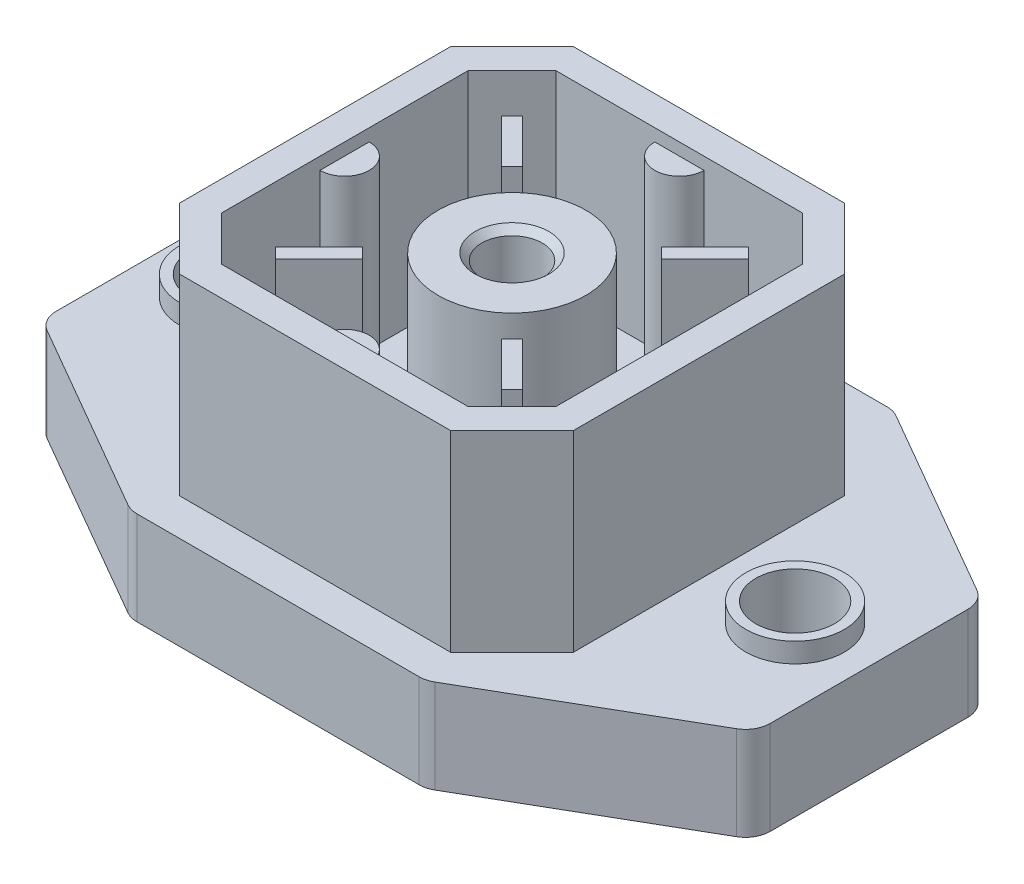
ISO-10303-21;
HEADER;
FILE_DESCRIPTION(('STEP AP214'),'2;1');
FILE_NAME('part.step','',(''),(''),'','','');
FILE_SCHEMA(('AUTOMOTIVE_DESIGN { 1 0 10303 214 1 1 1 1 }'));
ENDSEC;
DATA;
#1=APPLICATION_CONTEXT('core data for automotive mechanical design processes');
#2=APPLICATION_PROTOCOL_DEFINITION('international standard','automotive_design',2000,#1);
#3=PRODUCT_CONTEXT('',#1,'mechanical');
#4=PRODUCT('Part','Part','',(#3));
#5=PRODUCT_RELATED_PRODUCT_CATEGORY('part','',(#4));
#6=PRODUCT_DEFINITION_FORMATION('','',#4);
#7=PRODUCT_DEFINITION_CONTEXT('part definition',#1,'design');
#8=PRODUCT_DEFINITION('design','',#6,#7);
#9=PRODUCT_DEFINITION_SHAPE('','',#8);
#10=(LENGTH_UNIT() NAMED_UNIT(*) SI_UNIT(.MILLI.,.METRE.));
#11=(NAMED_UNIT(*) PLANE_ANGLE_UNIT() SI_UNIT($,.RADIAN.));
#12=(NAMED_UNIT(*) SI_UNIT($,.STERADIAN.) SOLID_ANGLE_UNIT());
#13=UNCERTAINTY_MEASURE_WITH_UNIT(LENGTH_MEASURE(1.E-05),#10,'distance_accuracy_value','');
#14=(GEOMETRIC_REPRESENTATION_CONTEXT(3) GLOBAL_UNCERTAINTY_ASSIGNED_CONTEXT((#13)) GLOBAL_UNIT_ASSIGNED_CONTEXT((#10,
#11,#12)) REPRESENTATION_CONTEXT('',''));
#15=CARTESIAN_POINT('',(0.,0.,0.));
#16=DIRECTION('',(0.,0.,1.));
#17=DIRECTION('',(1.,0.,0.));
#18=AXIS2_PLACEMENT_3D('',#15,#16,#17);
#19=CARTESIAN_POINT('',(-6.8,10.8,0.));
#20=DIRECTION('',(0.,-1.,0.));
#21=DIRECTION('',(0.,0.,-1.));
#22=AXIS2_PLACEMENT_3D('',#19,#20,#21);
#23=CYLINDRICAL_SURFACE('',#22,1.);
#24=DIRECTION('',(0.,-1.,0.));
#25=VECTOR('',#24,1.);
#26=CARTESIAN_POINT('',(-6.8,10.8,-1.));
#27=LINE('',#26,#25);
#28=CARTESIAN_POINT('',(-6.8,10.3,-1.));
#29=VERTEX_POINT('',#28);
#30=CARTESIAN_POINT('',(-6.8,3.,-1.));
#31=VERTEX_POINT('',#30);
#32=EDGE_CURVE('E456',#29,#31,#27,.T.);
#33=ORIENTED_EDGE('',*,*,#32,.F.);
#34=CARTESIAN_POINT('',(-6.8,10.3,0.));
#35=DIRECTION('',(0.,1.,0.));
#36=DIRECTION('',(0.,0.,1.));
#37=AXIS2_PLACEMENT_3D('',#34,#35,#36);
#38=CIRCLE('',#37,1.);
#39=CARTESIAN_POINT('',(-6.8,10.3,1.));
#40=VERTEX_POINT('',#39);
#41=EDGE_CURVE('E445',#29,#40,#38,.F.);
#42=ORIENTED_EDGE('',*,*,#41,.T.);
#43=DIRECTION('',(0.,-1.,0.));
#44=VECTOR('',#43,1.);
#45=CARTESIAN_POINT('',(-6.8,10.8,1.));
#46=LINE('',#45,#44);
#47=CARTESIAN_POINT('',(-6.8,3.,1.));
#48=VERTEX_POINT('',#47);
#49=EDGE_CURVE('E459',#40,#48,#46,.T.);
#50=ORIENTED_EDGE('',*,*,#49,.T.);
#51=CARTESIAN_POINT('',(-6.8,3.,0.));
#52=DIRECTION('',(0.,-1.,0.));
#53=DIRECTION('',(0.,0.,-1.));
#54=AXIS2_PLACEMENT_3D('',#51,#52,#53);
#55=CIRCLE('',#54,1.);
#56=EDGE_CURVE('E463',#31,#48,#55,.T.);
#57=ORIENTED_EDGE('',*,*,#56,.F.);
#58=EDGE_LOOP('',(#33,#42,#50,#57));
#59=FACE_BOUND('',#58,.T.);
#60=ADVANCED_FACE('F33',(#59),#23,.T.);
#61=CARTESIAN_POINT('',(0.,10.8,6.8));
#62=DIRECTION('',(0.,-1.,0.));
#63=DIRECTION('',(0.,0.,-1.));
#64=AXIS2_PLACEMENT_3D('',#61,#62,#63);
#65=CYLINDRICAL_SURFACE('',#64,1.);
#66=DIRECTION('',(0.,-1.,0.));
#67=VECTOR('',#66,1.);
#68=CARTESIAN_POINT('',(-1.,10.8,6.8));
#69=LINE('',#68,#67);
#70=CARTESIAN_POINT('',(-1.,10.3,6.8));
#71=VERTEX_POINT('',#70);
#72=CARTESIAN_POINT('',(-1.,3.,6.8));
#73=VERTEX_POINT('',#72);
#74=EDGE_CURVE('E990',#71,#73,#69,.T.);
#75=ORIENTED_EDGE('',*,*,#74,.F.);
#76=CARTESIAN_POINT('',(0.,10.3,6.8));
#77=DIRECTION('',(0.,1.,0.));
#78=DIRECTION('',(0.,0.,1.));
#79=AXIS2_PLACEMENT_3D('',#76,#77,#78);
#80=CIRCLE('',#79,1.);
#81=CARTESIAN_POINT('',(1.,10.3,6.8));
#82=VERTEX_POINT('',#81);
#83=EDGE_CURVE('E451',#71,#82,#80,.F.);
#84=ORIENTED_EDGE('',*,*,#83,.T.);
#85=DIRECTION('',(0.,-1.,0.));
#86=VECTOR('',#85,1.);
#87=CARTESIAN_POINT('',(1.,10.8,6.8));
#88=LINE('',#87,#86);
#89=CARTESIAN_POINT('',(0.999999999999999,3.,6.8));
#90=VERTEX_POINT('',#89);
#91=EDGE_CURVE('E988',#82,#90,#88,.T.);
#92=ORIENTED_EDGE('',*,*,#91,.T.);
#93=CARTESIAN_POINT('',(0.,3.,6.8));
#94=DIRECTION('',(0.,-1.,0.));
#95=DIRECTION('',(0.,0.,-1.));
#96=AXIS2_PLACEMENT_3D('',#93,#94,#95);
#97=CIRCLE('',#96,1.);
#98=EDGE_CURVE('E932',#73,#90,#97,.T.);
#99=ORIENTED_EDGE('',*,*,#98,.F.);
#100=EDGE_LOOP('',(#75,#84,#92,#99));
#101=FACE_BOUND('',#100,.T.);
#102=ADVANCED_FACE('F784',(#101),#65,.T.);
#103=CARTESIAN_POINT('',(6.8,10.8,1.));
#104=DIRECTION('',(-0.258819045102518,0.,0.965925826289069));
#105=DIRECTION('',(0.965925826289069,0.,0.258819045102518));
#106=AXIS2_PLACEMENT_3D('',#103,#104,#105);
#107=PLANE('',#106);
#108=DIRECTION('',(0.,-1.,0.));
#109=VECTOR('',#108,1.);
#110=CARTESIAN_POINT('',(6.8,10.8,1.));
#111=LINE('',#110,#109);
#112=CARTESIAN_POINT('',(6.8,10.3,1.));
#113=VERTEX_POINT('',#112);
#114=CARTESIAN_POINT('',(6.8,3.,1.));
#115=VERTEX_POINT('',#114);
#116=EDGE_CURVE('E980',#113,#115,#111,.T.);
#117=ORIENTED_EDGE('',*,*,#116,.F.);
#118=DIRECTION('',(-0.965925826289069,0.,-0.258819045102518));
#119=VECTOR('',#118,1.);
#120=CARTESIAN_POINT('',(6.8,10.3,1.));
#121=LINE('',#120,#119);
#122=CARTESIAN_POINT('',(6.3,10.3,0.86602540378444));
#123=VERTEX_POINT('',#122);
#124=EDGE_CURVE('E1029',#113,#123,#121,.T.);
#125=ORIENTED_EDGE('',*,*,#124,.T.);
#126=DIRECTION('',(0.,-1.,0.));
#127=VECTOR('',#126,1.);
#128=CARTESIAN_POINT('',(6.3,10.8,0.86602540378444));
#129=LINE('',#128,#127);
#130=CARTESIAN_POINT('',(6.3,3.,0.86602540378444));
#131=VERTEX_POINT('',#130);
#132=EDGE_CURVE('E978',#123,#131,#129,.T.);
#133=ORIENTED_EDGE('',*,*,#132,.T.);
#134=DIRECTION('',(-0.965925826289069,0.,-0.258819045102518));
#135=VECTOR('',#134,1.);
#136=CARTESIAN_POINT('',(6.8,3.,1.));
#137=LINE('',#136,#135);
#138=EDGE_CURVE('E942',#115,#131,#137,.T.);
#139=ORIENTED_EDGE('',*,*,#138,.F.);
#140=EDGE_LOOP('',(#117,#125,#133,#139));
#141=FACE_BOUND('',#140,.T.);
#142=ADVANCED_FACE('F789',(#141),#107,.T.);
#143=CARTESIAN_POINT('',(6.3,10.8,0.86602540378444));
#144=DIRECTION('',(-1.,0.,0.));
#145=DIRECTION('',(0.,0.,1.));
#146=AXIS2_PLACEMENT_3D('',#143,#144,#145);
#147=PLANE('',#146);
#148=ORIENTED_EDGE('',*,*,#132,.F.);
#149=DIRECTION('',(0.,0.,-1.));
#150=VECTOR('',#149,1.);
#151=CARTESIAN_POINT('',(6.3,10.3,0.86602540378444));
#152=LINE('',#151,#150);
#153=CARTESIAN_POINT('',(6.3,10.3,-0.86602540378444));
#154=VERTEX_POINT('',#153);
#155=EDGE_CURVE('E1033',#123,#154,#152,.T.);
#156=ORIENTED_EDGE('',*,*,#155,.T.);
#157=DIRECTION('',(0.,-1.,0.));
#158=VECTOR('',#157,1.);
#159=CARTESIAN_POINT('',(6.3,10.8,-0.86602540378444));
#160=LINE('',#159,#158);
#161=CARTESIAN_POINT('',(6.3,3.,-0.86602540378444));
#162=VERTEX_POINT('',#161);
#163=EDGE_CURVE('E976',#154,#162,#160,.T.);
#164=ORIENTED_EDGE('',*,*,#163,.T.);
#165=DIRECTION('',(0.,0.,-1.));
#166=VECTOR('',#165,1.);
#167=CARTESIAN_POINT('',(6.3,3.,0.86602540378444));
#168=LINE('',#167,#166);
#169=EDGE_CURVE('E945',#131,#162,#168,.T.);
#170=ORIENTED_EDGE('',*,*,#169,.F.);
#171=EDGE_LOOP('',(#148,#156,#164,#170));
#172=FACE_BOUND('',#171,.T.);
#173=ADVANCED_FACE('F1032',(#172),#147,.T.);
#174=CARTESIAN_POINT('',(6.3,10.8,-0.86602540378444));
#175=DIRECTION('',(-0.258819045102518,0.,-0.965925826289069));
#176=DIRECTION('',(-0.965925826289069,0.,0.258819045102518));
#177=AXIS2_PLACEMENT_3D('',#174,#175,#176);
#178=PLANE('',#177);
#179=ORIENTED_EDGE('',*,*,#163,.F.);
#180=DIRECTION('',(0.965925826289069,0.,-0.258819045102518));
#181=VECTOR('',#180,1.);
#182=CARTESIAN_POINT('',(6.3,10.3,-0.86602540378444));
#183=LINE('',#182,#181);
#184=CARTESIAN_POINT('',(6.8,10.3,-1.));
#185=VERTEX_POINT('',#184);
#186=EDGE_CURVE('E1041',#154,#185,#183,.T.);
#187=ORIENTED_EDGE('',*,*,#186,.T.);
#188=DIRECTION('',(0.,-1.,0.));
#189=VECTOR('',#188,1.);
#190=CARTESIAN_POINT('',(6.8,10.8,-1.));
#191=LINE('',#190,#189);
#192=CARTESIAN_POINT('',(6.8,3.,-1.));
#193=VERTEX_POINT('',#192);
#194=EDGE_CURVE('E974',#185,#193,#191,.T.);
#195=ORIENTED_EDGE('',*,*,#194,.T.);
#196=DIRECTION('',(0.965925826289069,0.,-0.258819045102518));
#197=VECTOR('',#196,1.);
#198=CARTESIAN_POINT('',(6.3,3.,-0.86602540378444));
#199=LINE('',#198,#197);
#200=EDGE_CURVE('E948',#162,#193,#199,.T.);
#201=ORIENTED_EDGE('',*,*,#200,.F.);
#202=EDGE_LOOP('',(#179,#187,#195,#201));
#203=FACE_BOUND('',#202,.T.);
#204=ADVANCED_FACE('F1038',(#203),#178,.T.);
#205=CARTESIAN_POINT('',(0.,10.8,-6.8));
#206=DIRECTION('',(0.,-1.,0.));
#207=DIRECTION('',(0.,0.,-1.));
#208=AXIS2_PLACEMENT_3D('',#205,#206,#207);
#209=CYLINDRICAL_SURFACE('',#208,1.);
#210=DIRECTION('',(0.,-1.,0.));
#211=VECTOR('',#210,1.);
#212=CARTESIAN_POINT('',(1.,10.8,-6.8));
#213=LINE('',#212,#211);
#214=CARTESIAN_POINT('',(1.,10.3,-6.8));
#215=VERTEX_POINT('',#214);
#216=CARTESIAN_POINT('',(1.,3.,-6.8));
#217=VERTEX_POINT('',#216);
#218=EDGE_CURVE('E966',#215,#217,#213,.T.);
#219=ORIENTED_EDGE('',*,*,#218,.F.);
#220=CARTESIAN_POINT('',(0.,10.3,-6.8));
#221=DIRECTION('',(0.,1.,0.));
#222=DIRECTION('',(0.,0.,1.));
#223=AXIS2_PLACEMENT_3D('',#220,#221,#222);
#224=CIRCLE('',#223,1.);
#225=CARTESIAN_POINT('',(-1.,10.3,-6.8));
#226=VERTEX_POINT('',#225);
#227=EDGE_CURVE('E1061',#215,#226,#224,.F.);
#228=ORIENTED_EDGE('',*,*,#227,.T.);
#229=DIRECTION('',(0.,-1.,0.));
#230=VECTOR('',#229,1.);
#231=CARTESIAN_POINT('',(-1.,10.8,-6.8));
#232=LINE('',#231,#230);
#233=CARTESIAN_POINT('',(-1.,3.,-6.8));
#234=VERTEX_POINT('',#233);
#235=EDGE_CURVE('E964',#226,#234,#232,.T.);
#236=ORIENTED_EDGE('',*,*,#235,.T.);
#237=CARTESIAN_POINT('',(0.,3.,-6.8));
#238=DIRECTION('',(0.,-1.,0.));
#239=DIRECTION('',(0.,0.,-1.));
#240=AXIS2_PLACEMENT_3D('',#237,#238,#239);
#241=CIRCLE('',#240,1.);
#242=EDGE_CURVE('E958',#217,#234,#241,.T.);
#243=ORIENTED_EDGE('',*,*,#242,.F.);
#244=EDGE_LOOP('',(#219,#228,#236,#243));
#245=FACE_BOUND('',#244,.T.);
#246=ADVANCED_FACE('F1060',(#245),#209,.T.);
#247=CARTESIAN_POINT('',(-2.8284271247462,10.8,-3.25269119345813));
#248=DIRECTION('',(-0.707106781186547,0.,-0.707106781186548));
#249=DIRECTION('',(-0.707106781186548,0.,0.707106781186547));
#250=AXIS2_PLACEMENT_3D('',#247,#248,#249);
#251=PLANE('',#250);
#252=DIRECTION('',(0.707106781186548,0.,-0.707106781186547));
#253=VECTOR('',#252,1.);
#254=CARTESIAN_POINT('',(-2.8284271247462,10.3,-3.25269119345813));
#255=LINE('',#254,#253);
#256=CARTESIAN_POINT('',(-3.25269119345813,10.3,-2.8284271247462));
#257=VERTEX_POINT('',#256);
#258=CARTESIAN_POINT('',(-2.8284271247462,10.3,-3.25269119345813));
#259=VERTEX_POINT('',#258);
#260=EDGE_CURVE('E1068',#257,#259,#255,.T.);
#261=ORIENTED_EDGE('',*,*,#260,.F.);
#262=DIRECTION('',(0.,-1.,0.));
#263=VECTOR('',#262,1.);
#264=CARTESIAN_POINT('',(-3.25269119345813,10.8,-2.8284271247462));
#265=LINE('',#264,#263);
#266=CARTESIAN_POINT('',(-3.25269119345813,3.,-2.8284271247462));
#267=VERTEX_POINT('',#266);
#268=EDGE_CURVE('E1143',#257,#267,#265,.T.);
#269=ORIENTED_EDGE('',*,*,#268,.T.);
#270=DIRECTION('',(-0.707106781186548,0.,0.707106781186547));
#271=VECTOR('',#270,1.);
#272=CARTESIAN_POINT('',(-2.8284271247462,3.,-3.25269119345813));
#273=LINE('',#272,#271);
#274=CARTESIAN_POINT('',(-2.8284271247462,3.,-3.25269119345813));
#275=VERTEX_POINT('',#274);
#276=EDGE_CURVE('E1160',#275,#267,#273,.T.);
#277=ORIENTED_EDGE('',*,*,#276,.F.);
#278=DIRECTION('',(0.,-1.,0.));
#279=VECTOR('',#278,1.);
#280=CARTESIAN_POINT('',(-2.8284271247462,10.8,-3.25269119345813));
#281=LINE('',#280,#279);
#282=EDGE_CURVE('E1151',#259,#275,#281,.T.);
#283=ORIENTED_EDGE('',*,*,#282,.F.);
#284=EDGE_LOOP('',(#261,#269,#277,#283));
#285=FACE_BOUND('',#284,.T.);
#286=ADVANCED_FACE('F1212',(#285),#251,.F.);
#287=CARTESIAN_POINT('',(-4.59619407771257,3.,-5.02045814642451));
#288=DIRECTION('',(0.707106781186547,0.,0.707106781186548));
#289=DIRECTION('',(0.707106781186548,0.,-0.707106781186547));
#290=AXIS2_PLACEMENT_3D('',#287,#288,#289);
#291=PLANE('',#290);
#292=DIRECTION('',(-0.707106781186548,0.,0.707106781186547));
#293=VECTOR('',#292,1.);
#294=CARTESIAN_POINT('',(-4.59619407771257,10.3,-5.02045814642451));
#295=LINE('',#294,#293);
#296=CARTESIAN_POINT('',(-4.59619407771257,10.3,-5.02045814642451));
#297=VERTEX_POINT('',#296);
#298=CARTESIAN_POINT('',(-5.0204581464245,10.3,-4.59619407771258));
#299=VERTEX_POINT('',#298);
#300=EDGE_CURVE('E1891',#297,#299,#295,.T.);
#301=ORIENTED_EDGE('',*,*,#300,.F.);
#302=DIRECTION('',(0.,1.,0.));
#303=VECTOR('',#302,1.);
#304=CARTESIAN_POINT('',(-4.59619407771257,3.,-5.02045814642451));
#305=LINE('',#304,#303);
#306=CARTESIAN_POINT('',(-4.59619407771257,3.,-5.02045814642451));
#307=VERTEX_POINT('',#306);
#308=EDGE_CURVE('E1154',#307,#297,#305,.T.);
#309=ORIENTED_EDGE('',*,*,#308,.F.);
#310=DIRECTION('',(-0.707106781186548,0.,0.707106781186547));
#311=VECTOR('',#310,1.);
#312=CARTESIAN_POINT('',(-4.59619407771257,3.,-5.02045814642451));
#313=LINE('',#312,#311);
#314=CARTESIAN_POINT('',(-5.0204581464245,3.,-4.59619407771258));
#315=VERTEX_POINT('',#314);
#316=EDGE_CURVE('E1157',#307,#315,#313,.T.);
#317=ORIENTED_EDGE('',*,*,#316,.T.);
#318=DIRECTION('',(0.,1.,0.));
#319=VECTOR('',#318,1.);
#320=CARTESIAN_POINT('',(-5.0204581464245,3.,-4.59619407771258));
#321=LINE('',#320,#319);
#322=EDGE_CURVE('E1148',#315,#299,#321,.T.);
#323=ORIENTED_EDGE('',*,*,#322,.T.);
#324=EDGE_LOOP('',(#301,#309,#317,#323));
#325=FACE_BOUND('',#324,.T.);
#326=ADVANCED_FACE('F1690',(#325),#291,.F.);
#327=CARTESIAN_POINT('',(-2.8284271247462,3.,-3.25269119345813));
#328=DIRECTION('',(0.707106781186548,0.,-0.707106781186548));
#329=DIRECTION('',(-0.707106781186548,0.,-0.707106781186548));
#330=AXIS2_PLACEMENT_3D('',#327,#328,#329);
#331=PLANE('',#330);
#332=ORIENTED_EDGE('',*,*,#308,.T.);
#333=DIRECTION('',(0.707106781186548,0.,0.707106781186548));
#334=VECTOR('',#333,1.);
#335=CARTESIAN_POINT('',(-2.8284271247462,10.3,-3.25269119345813));
#336=LINE('',#335,#334);
#337=EDGE_CURVE('E1064',#297,#259,#336,.T.);
#338=ORIENTED_EDGE('',*,*,#337,.T.);
#339=ORIENTED_EDGE('',*,*,#282,.T.);
#340=DIRECTION('',(-0.707106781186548,0.,-0.707106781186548));
#341=VECTOR('',#340,1.);
#342=CARTESIAN_POINT('',(-2.8284271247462,3.,-3.25269119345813));
#343=LINE('',#342,#341);
#344=EDGE_CURVE('E862',#275,#307,#343,.T.);
#345=ORIENTED_EDGE('',*,*,#344,.T.);
#346=EDGE_LOOP('',(#332,#338,#339,#345));
#347=FACE_BOUND('',#346,.T.);
#348=ADVANCED_FACE('F1700',(#347),#331,.T.);
#349=CARTESIAN_POINT('',(-3.25269119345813,3.,-2.8284271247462));
#350=DIRECTION('',(0.707106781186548,0.,-0.707106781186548));
#351=DIRECTION('',(-0.707106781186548,0.,-0.707106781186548));
#352=AXIS2_PLACEMENT_3D('',#349,#350,#351);
#353=PLANE('',#352);
#354=DIRECTION('',(0.707106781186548,0.,0.707106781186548));
#355=VECTOR('',#354,1.);
#356=CARTESIAN_POINT('',(-3.25269119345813,10.3,-2.8284271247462));
#357=LINE('',#356,#355);
#358=EDGE_CURVE('E1889',#299,#257,#357,.T.);
#359=ORIENTED_EDGE('',*,*,#358,.F.);
#360=ORIENTED_EDGE('',*,*,#322,.F.);
#361=DIRECTION('',(-0.707106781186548,0.,-0.707106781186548));
#362=VECTOR('',#361,1.);
#363=CARTESIAN_POINT('',(-3.25269119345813,3.,-2.8284271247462));
#364=LINE('',#363,#362);
#365=EDGE_CURVE('E1145',#267,#315,#364,.T.);
#366=ORIENTED_EDGE('',*,*,#365,.F.);
#367=ORIENTED_EDGE('',*,*,#268,.F.);
#368=EDGE_LOOP('',(#359,#360,#366,#367));
#369=FACE_BOUND('',#368,.T.);
#370=ADVANCED_FACE('F1710',(#369),#353,.F.);
#371=CARTESIAN_POINT('',(5.0204581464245,10.8,4.59619407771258));
#372=DIRECTION('',(-0.707106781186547,0.,-0.707106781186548));
#373=DIRECTION('',(-0.707106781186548,0.,0.707106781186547));
#374=AXIS2_PLACEMENT_3D('',#371,#372,#373);
#375=PLANE('',#374);
#376=DIRECTION('',(0.707106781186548,0.,-0.707106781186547));
#377=VECTOR('',#376,1.);
#378=CARTESIAN_POINT('',(5.0204581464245,10.3,4.59619407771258));
#379=LINE('',#378,#377);
#380=CARTESIAN_POINT('',(4.59619407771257,10.3,5.02045814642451));
#381=VERTEX_POINT('',#380);
#382=CARTESIAN_POINT('',(5.0204581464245,10.3,4.59619407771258));
#383=VERTEX_POINT('',#382);
#384=EDGE_CURVE('E1884',#381,#383,#379,.T.);
#385=ORIENTED_EDGE('',*,*,#384,.F.);
#386=DIRECTION('',(0.,-1.,0.));
#387=VECTOR('',#386,1.);
#388=CARTESIAN_POINT('',(4.59619407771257,10.8,5.02045814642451));
#389=LINE('',#388,#387);
#390=CARTESIAN_POINT('',(4.59619407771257,3.,5.02045814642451));
#391=VERTEX_POINT('',#390);
#392=EDGE_CURVE('E1124',#381,#391,#389,.T.);
#393=ORIENTED_EDGE('',*,*,#392,.T.);
#394=DIRECTION('',(-0.707106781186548,0.,0.707106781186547));
#395=VECTOR('',#394,1.);
#396=CARTESIAN_POINT('',(5.0204581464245,3.,4.59619407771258));
#397=LINE('',#396,#395);
#398=CARTESIAN_POINT('',(5.0204581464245,3.,4.59619407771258));
#399=VERTEX_POINT('',#398);
#400=EDGE_CURVE('E1141',#399,#391,#397,.T.);
#401=ORIENTED_EDGE('',*,*,#400,.F.);
#402=DIRECTION('',(0.,-1.,0.));
#403=VECTOR('',#402,1.);
#404=CARTESIAN_POINT('',(5.0204581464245,10.8,4.59619407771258));
#405=LINE('',#404,#403);
#406=EDGE_CURVE('E1132',#383,#399,#405,.T.);
#407=ORIENTED_EDGE('',*,*,#406,.F.);
#408=EDGE_LOOP('',(#385,#393,#401,#407));
#409=FACE_BOUND('',#408,.T.);
#410=ADVANCED_FACE('F1720',(#409),#375,.F.);
#411=CARTESIAN_POINT('',(3.25269119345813,3.,2.8284271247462));
#412=DIRECTION('',(0.707106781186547,0.,0.707106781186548));
#413=DIRECTION('',(0.707106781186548,0.,-0.707106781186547));
#414=AXIS2_PLACEMENT_3D('',#411,#412,#413);
#415=PLANE('',#414);
#416=DIRECTION('',(-0.707106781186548,0.,0.707106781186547));
#417=VECTOR('',#416,1.);
#418=CARTESIAN_POINT('',(3.25269119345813,10.3,2.8284271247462));
#419=LINE('',#418,#417);
#420=CARTESIAN_POINT('',(3.25269119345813,10.3,2.8284271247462));
#421=VERTEX_POINT('',#420);
#422=CARTESIAN_POINT('',(2.8284271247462,10.3,3.25269119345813));
#423=VERTEX_POINT('',#422);
#424=EDGE_CURVE('E1882',#421,#423,#419,.T.);
#425=ORIENTED_EDGE('',*,*,#424,.F.);
#426=DIRECTION('',(0.,1.,0.));
#427=VECTOR('',#426,1.);
#428=CARTESIAN_POINT('',(3.25269119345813,3.,2.8284271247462));
#429=LINE('',#428,#427);
#430=CARTESIAN_POINT('',(3.25269119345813,3.,2.8284271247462));
#431=VERTEX_POINT('',#430);
#432=EDGE_CURVE('E1135',#431,#421,#429,.T.);
#433=ORIENTED_EDGE('',*,*,#432,.F.);
#434=DIRECTION('',(-0.707106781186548,0.,0.707106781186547));
#435=VECTOR('',#434,1.);
#436=CARTESIAN_POINT('',(3.25269119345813,3.,2.8284271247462));
#437=LINE('',#436,#435);
#438=CARTESIAN_POINT('',(2.8284271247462,3.,3.25269119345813));
#439=VERTEX_POINT('',#438);
#440=EDGE_CURVE('E1138',#431,#439,#437,.T.);
#441=ORIENTED_EDGE('',*,*,#440,.T.);
#442=DIRECTION('',(0.,1.,0.));
#443=VECTOR('',#442,1.);
#444=CARTESIAN_POINT('',(2.8284271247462,3.,3.25269119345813));
#445=LINE('',#444,#443);
#446=EDGE_CURVE('E1129',#439,#423,#445,.T.);
#447=ORIENTED_EDGE('',*,*,#446,.T.);
#448=EDGE_LOOP('',(#425,#433,#441,#447));
#449=FACE_BOUND('',#448,.T.);
#450=ADVANCED_FACE('F1730',(#449),#415,.F.);
#451=CARTESIAN_POINT('',(5.0204581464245,3.,4.59619407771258));
#452=DIRECTION('',(0.707106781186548,0.,-0.707106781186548));
#453=DIRECTION('',(-0.707106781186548,0.,-0.707106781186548));
#454=AXIS2_PLACEMENT_3D('',#451,#452,#453);
#455=PLANE('',#454);
#456=ORIENTED_EDGE('',*,*,#432,.T.);
#457=DIRECTION('',(0.707106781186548,0.,0.707106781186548));
#458=VECTOR('',#457,1.);
#459=CARTESIAN_POINT('',(5.0204581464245,10.3,4.59619407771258));
#460=LINE('',#459,#458);
#461=EDGE_CURVE('E1886',#421,#383,#460,.T.);
#462=ORIENTED_EDGE('',*,*,#461,.T.);
#463=ORIENTED_EDGE('',*,*,#406,.T.);
#464=DIRECTION('',(-0.707106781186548,0.,-0.707106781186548));
#465=VECTOR('',#464,1.);
#466=CARTESIAN_POINT('',(5.0204581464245,3.,4.59619407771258));
#467=LINE('',#466,#465);
#468=EDGE_CURVE('E857',#399,#431,#467,.T.);
#469=ORIENTED_EDGE('',*,*,#468,.T.);
#470=EDGE_LOOP('',(#456,#462,#463,#469));
#471=FACE_BOUND('',#470,.T.);
#472=ADVANCED_FACE('F1740',(#471),#455,.T.);
#473=CARTESIAN_POINT('',(4.59619407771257,3.,5.02045814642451));
#474=DIRECTION('',(0.707106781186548,0.,-0.707106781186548));
#475=DIRECTION('',(-0.707106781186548,0.,-0.707106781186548));
#476=AXIS2_PLACEMENT_3D('',#473,#474,#475);
#477=PLANE('',#476);
#478=DIRECTION('',(0.707106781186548,0.,0.707106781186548));
#479=VECTOR('',#478,1.);
#480=CARTESIAN_POINT('',(4.59619407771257,10.3,5.02045814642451));
#481=LINE('',#480,#479);
#482=EDGE_CURVE('E1880',#423,#381,#481,.T.);
#483=ORIENTED_EDGE('',*,*,#482,.F.);
#484=ORIENTED_EDGE('',*,*,#446,.F.);
#485=DIRECTION('',(-0.707106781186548,0.,-0.707106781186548));
#486=VECTOR('',#485,1.);
#487=CARTESIAN_POINT('',(4.59619407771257,3.,5.02045814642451));
#488=LINE('',#487,#486);
#489=EDGE_CURVE('E1126',#391,#439,#488,.T.);
#490=ORIENTED_EDGE('',*,*,#489,.F.);
#491=ORIENTED_EDGE('',*,*,#392,.F.);
#492=EDGE_LOOP('',(#483,#484,#490,#491));
#493=FACE_BOUND('',#492,.T.);
#494=ADVANCED_FACE('F1750',(#493),#477,.F.);
#495=CARTESIAN_POINT('',(3.25269119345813,10.8,-2.8284271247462));
#496=DIRECTION('',(0.707106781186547,0.,-0.707106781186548));
#497=DIRECTION('',(-0.707106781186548,0.,-0.707106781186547));
#498=AXIS2_PLACEMENT_3D('',#495,#496,#497);
#499=PLANE('',#498);
#500=DIRECTION('',(0.707106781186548,0.,0.707106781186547));
#501=VECTOR('',#500,1.);
#502=CARTESIAN_POINT('',(3.25269119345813,10.3,-2.8284271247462));
#503=LINE('',#502,#501);
#504=CARTESIAN_POINT('',(2.8284271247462,10.3,-3.25269119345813));
#505=VERTEX_POINT('',#504);
#506=CARTESIAN_POINT('',(3.25269119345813,10.3,-2.8284271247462));
#507=VERTEX_POINT('',#506);
#508=EDGE_CURVE('E1875',#505,#507,#503,.T.);
#509=ORIENTED_EDGE('',*,*,#508,.F.);
#510=DIRECTION('',(0.,-1.,0.));
#511=VECTOR('',#510,1.);
#512=CARTESIAN_POINT('',(2.8284271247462,10.8,-3.25269119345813));
#513=LINE('',#512,#511);
#514=CARTESIAN_POINT('',(2.8284271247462,3.,-3.25269119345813));
#515=VERTEX_POINT('',#514);
#516=EDGE_CURVE('E1105',#505,#515,#513,.T.);
#517=ORIENTED_EDGE('',*,*,#516,.T.);
#518=DIRECTION('',(-0.707106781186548,0.,-0.707106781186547));
#519=VECTOR('',#518,1.);
#520=CARTESIAN_POINT('',(3.25269119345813,3.,-2.8284271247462));
#521=LINE('',#520,#519);
#522=CARTESIAN_POINT('',(3.25269119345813,3.,-2.8284271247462));
#523=VERTEX_POINT('',#522);
#524=EDGE_CURVE('E1122',#523,#515,#521,.T.);
#525=ORIENTED_EDGE('',*,*,#524,.F.);
#526=DIRECTION('',(0.,-1.,0.));
#527=VECTOR('',#526,1.);
#528=CARTESIAN_POINT('',(3.25269119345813,10.8,-2.8284271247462));
#529=LINE('',#528,#527);
#530=EDGE_CURVE('E1113',#507,#523,#529,.T.);
#531=ORIENTED_EDGE('',*,*,#530,.F.);
#532=EDGE_LOOP('',(#509,#517,#525,#531));
#533=FACE_BOUND('',#532,.T.);
#534=ADVANCED_FACE('F1760',(#533),#499,.F.);
#535=CARTESIAN_POINT('',(5.0204581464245,3.,-4.59619407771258));
#536=DIRECTION('',(-0.707106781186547,0.,0.707106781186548));
#537=DIRECTION('',(0.707106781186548,0.,0.707106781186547));
#538=AXIS2_PLACEMENT_3D('',#535,#536,#537);
#539=PLANE('',#538);
#540=DIRECTION('',(-0.707106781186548,0.,-0.707106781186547));
#541=VECTOR('',#540,1.);
#542=CARTESIAN_POINT('',(5.0204581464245,10.3,-4.59619407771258));
#543=LINE('',#542,#541);
#544=CARTESIAN_POINT('',(5.0204581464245,10.3,-4.59619407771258));
#545=VERTEX_POINT('',#544);
#546=CARTESIAN_POINT('',(4.59619407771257,10.3,-5.02045814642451));
#547=VERTEX_POINT('',#546);
#548=EDGE_CURVE('E1873',#545,#547,#543,.T.);
#549=ORIENTED_EDGE('',*,*,#548,.F.);
#550=DIRECTION('',(0.,1.,0.));
#551=VECTOR('',#550,1.);
#552=CARTESIAN_POINT('',(5.0204581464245,3.,-4.59619407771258));
#553=LINE('',#552,#551);
#554=CARTESIAN_POINT('',(5.0204581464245,3.,-4.59619407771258));
#555=VERTEX_POINT('',#554);
#556=EDGE_CURVE('E1116',#555,#545,#553,.T.);
#557=ORIENTED_EDGE('',*,*,#556,.F.);
#558=DIRECTION('',(-0.707106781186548,0.,-0.707106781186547));
#559=VECTOR('',#558,1.);
#560=CARTESIAN_POINT('',(5.0204581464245,3.,-4.59619407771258));
#561=LINE('',#560,#559);
#562=CARTESIAN_POINT('',(4.59619407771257,3.,-5.0204581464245));
#563=VERTEX_POINT('',#562);
#564=EDGE_CURVE('E1119',#555,#563,#561,.T.);
#565=ORIENTED_EDGE('',*,*,#564,.T.);
#566=DIRECTION('',(0.,1.,0.));
#567=VECTOR('',#566,1.);
#568=CARTESIAN_POINT('',(4.59619407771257,3.,-5.02045814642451));
#569=LINE('',#568,#567);
#570=EDGE_CURVE('E1110',#563,#547,#569,.T.);
#571=ORIENTED_EDGE('',*,*,#570,.T.);
#572=EDGE_LOOP('',(#549,#557,#565,#571));
#573=FACE_BOUND('',#572,.T.);
#574=ADVANCED_FACE('F1770',(#573),#539,.F.);
#575=CARTESIAN_POINT('',(3.25269119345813,3.,-2.8284271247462));
#576=DIRECTION('',(0.707106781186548,0.,0.707106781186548));
#577=DIRECTION('',(0.707106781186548,0.,-0.707106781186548));
#578=AXIS2_PLACEMENT_3D('',#575,#576,#577);
#579=PLANE('',#578);
#580=ORIENTED_EDGE('',*,*,#556,.T.);
#581=DIRECTION('',(-0.707106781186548,0.,0.707106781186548));
#582=VECTOR('',#581,1.);
#583=CARTESIAN_POINT('',(3.25269119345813,10.3,-2.8284271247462));
#584=LINE('',#583,#582);
#585=EDGE_CURVE('E1877',#545,#507,#584,.T.);
#586=ORIENTED_EDGE('',*,*,#585,.T.);
#587=ORIENTED_EDGE('',*,*,#530,.T.);
#588=DIRECTION('',(0.707106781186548,0.,-0.707106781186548));
#589=VECTOR('',#588,1.);
#590=CARTESIAN_POINT('',(3.25269119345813,3.,-2.8284271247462));
#591=LINE('',#590,#589);
#592=EDGE_CURVE('E852',#523,#555,#591,.T.);
#593=ORIENTED_EDGE('',*,*,#592,.T.);
#594=EDGE_LOOP('',(#580,#586,#587,#593));
#595=FACE_BOUND('',#594,.T.);
#596=ADVANCED_FACE('F1780',(#595),#579,.T.);
#597=CARTESIAN_POINT('',(2.8284271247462,3.,-3.25269119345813));
#598=DIRECTION('',(0.707106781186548,0.,0.707106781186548));
#599=DIRECTION('',(0.707106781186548,0.,-0.707106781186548));
#600=AXIS2_PLACEMENT_3D('',#597,#598,#599);
#601=PLANE('',#600);
#602=DIRECTION('',(-0.707106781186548,0.,0.707106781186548));
#603=VECTOR('',#602,1.);
#604=CARTESIAN_POINT('',(2.8284271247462,10.3,-3.25269119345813));
#605=LINE('',#604,#603);
#606=EDGE_CURVE('E1871',#547,#505,#605,.T.);
#607=ORIENTED_EDGE('',*,*,#606,.F.);
#608=ORIENTED_EDGE('',*,*,#570,.F.);
#609=DIRECTION('',(0.707106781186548,0.,-0.707106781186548));
#610=VECTOR('',#609,1.);
#611=CARTESIAN_POINT('',(2.8284271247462,3.,-3.25269119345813));
#612=LINE('',#611,#610);
#613=EDGE_CURVE('E1107',#515,#563,#612,.T.);
#614=ORIENTED_EDGE('',*,*,#613,.F.);
#615=ORIENTED_EDGE('',*,*,#516,.F.);
#616=EDGE_LOOP('',(#607,#608,#614,#615));
#617=FACE_BOUND('',#616,.T.);
#618=ADVANCED_FACE('F1790',(#617),#601,.F.);
#619=CARTESIAN_POINT('',(-4.59619407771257,10.8,5.02045814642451));
#620=DIRECTION('',(0.707106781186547,0.,-0.707106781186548));
#621=DIRECTION('',(-0.707106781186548,0.,-0.707106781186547));
#622=AXIS2_PLACEMENT_3D('',#619,#620,#621);
#623=PLANE('',#622);
#624=DIRECTION('',(0.707106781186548,0.,0.707106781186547));
#625=VECTOR('',#624,1.);
#626=CARTESIAN_POINT('',(-4.59619407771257,10.3,5.02045814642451));
#627=LINE('',#626,#625);
#628=CARTESIAN_POINT('',(-5.0204581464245,10.3,4.59619407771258));
#629=VERTEX_POINT('',#628);
#630=CARTESIAN_POINT('',(-4.59619407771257,10.3,5.02045814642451));
#631=VERTEX_POINT('',#630);
#632=EDGE_CURVE('E1866',#629,#631,#627,.T.);
#633=ORIENTED_EDGE('',*,*,#632,.F.);
#634=DIRECTION('',(0.,-1.,0.));
#635=VECTOR('',#634,1.);
#636=CARTESIAN_POINT('',(-5.0204581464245,10.8,4.59619407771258));
#637=LINE('',#636,#635);
#638=CARTESIAN_POINT('',(-5.0204581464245,3.,4.59619407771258));
#639=VERTEX_POINT('',#638);
#640=EDGE_CURVE('E1086',#629,#639,#637,.T.);
#641=ORIENTED_EDGE('',*,*,#640,.T.);
#642=DIRECTION('',(-0.707106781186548,0.,-0.707106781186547));
#643=VECTOR('',#642,1.);
#644=CARTESIAN_POINT('',(-4.59619407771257,3.,5.02045814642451));
#645=LINE('',#644,#643);
#646=CARTESIAN_POINT('',(-4.59619407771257,3.,5.02045814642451));
#647=VERTEX_POINT('',#646);
#648=EDGE_CURVE('E1103',#647,#639,#645,.T.);
#649=ORIENTED_EDGE('',*,*,#648,.F.);
#650=DIRECTION('',(0.,-1.,0.));
#651=VECTOR('',#650,1.);
#652=CARTESIAN_POINT('',(-4.59619407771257,10.8,5.02045814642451));
#653=LINE('',#652,#651);
#654=EDGE_CURVE('E1094',#631,#647,#653,.T.);
#655=ORIENTED_EDGE('',*,*,#654,.F.);
#656=EDGE_LOOP('',(#633,#641,#649,#655));
#657=FACE_BOUND('',#656,.T.);
#658=ADVANCED_FACE('F1800',(#657),#623,.F.);
#659=CARTESIAN_POINT('',(-2.8284271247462,3.,3.25269119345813));
#660=DIRECTION('',(-0.707106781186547,0.,0.707106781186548));
#661=DIRECTION('',(0.707106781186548,0.,0.707106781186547));
#662=AXIS2_PLACEMENT_3D('',#659,#660,#661);
#663=PLANE('',#662);
#664=DIRECTION('',(-0.707106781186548,0.,-0.707106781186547));
#665=VECTOR('',#664,1.);
#666=CARTESIAN_POINT('',(-2.8284271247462,10.3,3.25269119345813));
#667=LINE('',#666,#665);
#668=CARTESIAN_POINT('',(-2.8284271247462,10.3,3.25269119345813));
#669=VERTEX_POINT('',#668);
#670=CARTESIAN_POINT('',(-3.25269119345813,10.3,2.8284271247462));
#671=VERTEX_POINT('',#670);
#672=EDGE_CURVE('E1861',#669,#671,#667,.T.);
#673=ORIENTED_EDGE('',*,*,#672,.F.);
#674=DIRECTION('',(0.,1.,0.));
#675=VECTOR('',#674,1.);
#676=CARTESIAN_POINT('',(-2.8284271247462,3.,3.25269119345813));
#677=LINE('',#676,#675);
#678=CARTESIAN_POINT('',(-2.8284271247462,3.,3.25269119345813));
#679=VERTEX_POINT('',#678);
#680=EDGE_CURVE('E1097',#679,#669,#677,.T.);
#681=ORIENTED_EDGE('',*,*,#680,.F.);
#682=DIRECTION('',(-0.707106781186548,0.,-0.707106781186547));
#683=VECTOR('',#682,1.);
#684=CARTESIAN_POINT('',(-2.8284271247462,3.,3.25269119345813));
#685=LINE('',#684,#683);
#686=CARTESIAN_POINT('',(-3.25269119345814,3.,2.8284271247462));
#687=VERTEX_POINT('',#686);
#688=EDGE_CURVE('E1100',#679,#687,#685,.T.);
#689=ORIENTED_EDGE('',*,*,#688,.T.);
#690=DIRECTION('',(0.,1.,0.));
#691=VECTOR('',#690,1.);
#692=CARTESIAN_POINT('',(-3.25269119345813,3.,2.8284271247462));
#693=LINE('',#692,#691);
#694=EDGE_CURVE('E1091',#687,#671,#693,.T.);
#695=ORIENTED_EDGE('',*,*,#694,.T.);
#696=EDGE_LOOP('',(#673,#681,#689,#695));
#697=FACE_BOUND('',#696,.T.);
#698=ADVANCED_FACE('F1810',(#697),#663,.F.);
#699=CARTESIAN_POINT('',(-4.59619407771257,3.,5.02045814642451));
#700=DIRECTION('',(0.707106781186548,0.,0.707106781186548));
#701=DIRECTION('',(0.707106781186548,0.,-0.707106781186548));
#702=AXIS2_PLACEMENT_3D('',#699,#700,#701);
#703=PLANE('',#702);
#704=ORIENTED_EDGE('',*,*,#680,.T.);
#705=DIRECTION('',(-0.707106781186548,0.,0.707106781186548));
#706=VECTOR('',#705,1.);
#707=CARTESIAN_POINT('',(-4.59619407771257,10.3,5.02045814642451));
#708=LINE('',#707,#706);
#709=EDGE_CURVE('E1868',#669,#631,#708,.T.);
#710=ORIENTED_EDGE('',*,*,#709,.T.);
#711=ORIENTED_EDGE('',*,*,#654,.T.);
#712=DIRECTION('',(0.707106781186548,0.,-0.707106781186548));
#713=VECTOR('',#712,1.);
#714=CARTESIAN_POINT('',(-4.59619407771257,3.,5.02045814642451));
#715=LINE('',#714,#713);
#716=EDGE_CURVE('E847',#647,#679,#715,.T.);
#717=ORIENTED_EDGE('',*,*,#716,.T.);
#718=EDGE_LOOP('',(#704,#710,#711,#717));
#719=FACE_BOUND('',#718,.T.);
#720=ADVANCED_FACE('F770',(#719),#703,.T.);
#721=CARTESIAN_POINT('',(-5.0204581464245,3.,4.59619407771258));
#722=DIRECTION('',(0.707106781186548,0.,0.707106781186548));
#723=DIRECTION('',(0.707106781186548,0.,-0.707106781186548));
#724=AXIS2_PLACEMENT_3D('',#721,#722,#723);
#725=PLANE('',#724);
#726=DIRECTION('',(-0.707106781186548,0.,0.707106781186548));
#727=VECTOR('',#726,1.);
#728=CARTESIAN_POINT('',(-5.0204581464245,10.3,4.59619407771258));
#729=LINE('',#728,#727);
#730=EDGE_CURVE('E11',#671,#629,#729,.T.);
#731=ORIENTED_EDGE('',*,*,#730,.F.);
#732=ORIENTED_EDGE('',*,*,#694,.F.);
#733=DIRECTION('',(0.707106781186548,0.,-0.707106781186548));
#734=VECTOR('',#733,1.);
#735=CARTESIAN_POINT('',(-5.0204581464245,3.,4.59619407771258));
#736=LINE('',#735,#734);
#737=EDGE_CURVE('E1088',#639,#687,#736,.T.);
#738=ORIENTED_EDGE('',*,*,#737,.F.);
#739=ORIENTED_EDGE('',*,*,#640,.F.);
#740=EDGE_LOOP('',(#731,#732,#738,#739));
#741=FACE_BOUND('',#740,.T.);
#742=ADVANCED_FACE('F758',(#741),#725,.F.);
#743=CARTESIAN_POINT('',(-13.4999999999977,0.,-4.01517244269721));
#744=DIRECTION('',(0.,1.,0.));
#745=DIRECTION('',(0.,0.,1.));
#746=AXIS2_PLACEMENT_3D('',#743,#744,#745);
#747=PLANE('',#746);
#748=CARTESIAN_POINT('',(-4.06586399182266,0.,-4.06586399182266));
#749=DIRECTION('',(0.,1.,0.));
#750=DIRECTION('',(0.,0.,1.));
#751=AXIS2_PLACEMENT_3D('',#748,#749,#750);
#752=CIRCLE('',#751,0.500000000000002);
#753=CARTESIAN_POINT('',(-4.06586399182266,0.,-3.56586399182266));
#754=VERTEX_POINT('',#753);
#755=EDGE_CURVE('E747',#754,#754,#752,.F.);
#756=ORIENTED_EDGE('',*,*,#755,.F.);
#757=EDGE_LOOP('',(#756));
#758=FACE_BOUND('',#757,.T.);
#759=CARTESIAN_POINT('',(4.06586399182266,0.,-4.06586399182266));
#760=DIRECTION('',(0.,1.,0.));
#761=DIRECTION('',(0.,0.,1.));
#762=AXIS2_PLACEMENT_3D('',#759,#760,#761);
#763=CIRCLE('',#762,0.500000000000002);
#764=CARTESIAN_POINT('',(4.06586399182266,0.,-3.56586399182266));
#765=VERTEX_POINT('',#764);
#766=EDGE_CURVE('E712',#765,#765,#763,.F.);
#767=ORIENTED_EDGE('',*,*,#766,.F.);
#768=EDGE_LOOP('',(#767));
#769=FACE_BOUND('',#768,.T.);
#770=DIRECTION('',(0.,0.,1.));
#771=VECTOR('',#770,1.);
#772=CARTESIAN_POINT('',(-8.,0.,-5.5057395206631));
#773=LINE('',#772,#771);
#774=CARTESIAN_POINT('',(-8.,0.,-5.5057395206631));
#775=VERTEX_POINT('',#774);
#776=CARTESIAN_POINT('',(-8.,0.,5.5057395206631));
#777=VERTEX_POINT('',#776);
#778=EDGE_CURVE('E615',#775,#777,#773,.T.);
#779=ORIENTED_EDGE('',*,*,#778,.F.);
#780=DIRECTION('',(-0.707106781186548,0.,0.707106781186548));
#781=VECTOR('',#780,1.);
#782=CARTESIAN_POINT('',(-5.5057395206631,0.,-8.));
#783=LINE('',#782,#781);
#784=CARTESIAN_POINT('',(-5.5057395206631,0.,-8.));
#785=VERTEX_POINT('',#784);
#786=EDGE_CURVE('E586',#785,#775,#783,.T.);
#787=ORIENTED_EDGE('',*,*,#786,.F.);
#788=DIRECTION('',(-1.,0.,0.));
#789=VECTOR('',#788,1.);
#790=CARTESIAN_POINT('',(5.5057395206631,0.,-8.));
#791=LINE('',#790,#789);
#792=CARTESIAN_POINT('',(5.5057395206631,0.,-8.));
#793=VERTEX_POINT('',#792);
#794=EDGE_CURVE('E591',#793,#785,#791,.T.);
#795=ORIENTED_EDGE('',*,*,#794,.F.);
#796=DIRECTION('',(-0.707106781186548,0.,-0.707106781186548));
#797=VECTOR('',#796,1.);
#798=CARTESIAN_POINT('',(8.,0.,-5.5057395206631));
#799=LINE('',#798,#797);
#800=CARTESIAN_POINT('',(8.,0.,-5.5057395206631));
#801=VERTEX_POINT('',#800);
#802=EDGE_CURVE('E630',#801,#793,#799,.T.);
#803=ORIENTED_EDGE('',*,*,#802,.F.);
#804=DIRECTION('',(0.,0.,-1.));
#805=VECTOR('',#804,1.);
#806=CARTESIAN_POINT('',(8.,0.,5.5057395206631));
#807=LINE('',#806,#805);
#808=CARTESIAN_POINT('',(8.,0.,5.5057395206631));
#809=VERTEX_POINT('',#808);
#810=EDGE_CURVE('E627',#809,#801,#807,.T.);
#811=ORIENTED_EDGE('',*,*,#810,.F.);
#812=DIRECTION('',(0.707106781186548,0.,-0.707106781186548));
#813=VECTOR('',#812,1.);
#814=CARTESIAN_POINT('',(5.5057395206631,0.,8.));
#815=LINE('',#814,#813);
#816=CARTESIAN_POINT('',(5.5057395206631,0.,8.));
#817=VERTEX_POINT('',#816);
#818=EDGE_CURVE('E624',#817,#809,#815,.T.);
#819=ORIENTED_EDGE('',*,*,#818,.F.);
#820=DIRECTION('',(1.,0.,0.));
#821=VECTOR('',#820,1.);
#822=CARTESIAN_POINT('',(-5.5057395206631,0.,8.));
#823=LINE('',#822,#821);
#824=CARTESIAN_POINT('',(-5.5057395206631,0.,8.));
#825=VERTEX_POINT('',#824);
#826=EDGE_CURVE('E621',#825,#817,#823,.T.);
#827=ORIENTED_EDGE('',*,*,#826,.F.);
#828=DIRECTION('',(0.707106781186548,0.,0.707106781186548));
#829=VECTOR('',#828,1.);
#830=CARTESIAN_POINT('',(-8.,0.,5.5057395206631));
#831=LINE('',#830,#829);
#832=EDGE_CURVE('E618',#777,#825,#831,.T.);
#833=ORIENTED_EDGE('',*,*,#832,.F.);
#834=EDGE_LOOP('',(#779,#787,#795,#803,#811,#819,#827,#833));
#835=FACE_BOUND('',#834,.T.);
#836=CARTESIAN_POINT('',(-4.06586399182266,0.,4.06586399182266));
#837=DIRECTION('',(0.,1.,0.));
#838=DIRECTION('',(0.,0.,1.));
#839=AXIS2_PLACEMENT_3D('',#836,#837,#838);
#840=CIRCLE('',#839,0.500000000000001);
#841=CARTESIAN_POINT('',(-4.06586399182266,0.,4.56586399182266));
#842=VERTEX_POINT('',#841);
#843=EDGE_CURVE('E744',#842,#842,#840,.F.);
#844=ORIENTED_EDGE('',*,*,#843,.F.);
#845=EDGE_LOOP('',(#844));
#846=FACE_BOUND('',#845,.T.);
#847=CARTESIAN_POINT('',(4.06586399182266,0.,4.06586399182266));
#848=DIRECTION('',(0.,1.,0.));
#849=DIRECTION('',(0.,0.,1.));
#850=AXIS2_PLACEMENT_3D('',#847,#848,#849);
#851=CIRCLE('',#850,0.500000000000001);
#852=CARTESIAN_POINT('',(4.06586399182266,0.,4.56586399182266));
#853=VERTEX_POINT('',#852);
#854=EDGE_CURVE('E41',#853,#853,#851,.F.);
#855=ORIENTED_EDGE('',*,*,#854,.F.);
#856=EDGE_LOOP('',(#855));
#857=FACE_BOUND('',#856,.T.);
#858=ADVANCED_FACE('F755',(#758,#769,#835,#846,#857),#747,.F.);
#859=CARTESIAN_POINT('',(0.,10.3,0.));
#860=DIRECTION('',(0.,1.,0.));
#861=DIRECTION('',(0.,0.,1.));
#862=AXIS2_PLACEMENT_3D('',#859,#860,#861);
#863=PLANE('',#862);
#864=CARTESIAN_POINT('',(0.,10.3,0.));
#865=DIRECTION('',(0.,1.,0.));
#866=DIRECTION('',(0.,0.,1.));
#867=AXIS2_PLACEMENT_3D('',#864,#865,#866);
#868=CIRCLE('',#867,3.);
#869=CARTESIAN_POINT('',(0.,10.3,3.));
#870=VERTEX_POINT('',#869);
#871=EDGE_CURVE('E870',#870,#870,#868,.T.);
#872=ORIENTED_EDGE('',*,*,#871,.T.);
#873=EDGE_LOOP('',(#872));
#874=FACE_BOUND('',#873,.T.);
#875=CARTESIAN_POINT('',(0.,10.3,0.));
#876=DIRECTION('',(0.,1.,0.));
#877=DIRECTION('',(0.,0.,1.));
#878=AXIS2_PLACEMENT_3D('',#875,#876,#877);
#879=CIRCLE('',#878,1.5);
#880=CARTESIAN_POINT('',(0.,10.3,1.5));
#881=VERTEX_POINT('',#880);
#882=EDGE_CURVE('E871',#881,#881,#879,.T.);
#883=ORIENTED_EDGE('',*,*,#882,.F.);
#884=EDGE_LOOP('',(#883));
#885=FACE_BOUND('',#884,.T.);
#886=ADVANCED_FACE('F757',(#874,#885),#863,.T.);
#887=CARTESIAN_POINT('',(-13.4999999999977,3.,-4.01517244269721));
#888=DIRECTION('',(0.,1.,0.));
#889=DIRECTION('',(0.,0.,1.));
#890=AXIS2_PLACEMENT_3D('',#887,#888,#889);
#891=PLANE('',#890);
#892=ORIENTED_EDGE('',*,*,#716,.F.);
#893=ORIENTED_EDGE('',*,*,#648,.T.);
#894=ORIENTED_EDGE('',*,*,#737,.T.);
#895=ORIENTED_EDGE('',*,*,#688,.F.);
#896=EDGE_LOOP('',(#892,#893,#894,#895));
#897=FACE_BOUND('',#896,.T.);
#898=ORIENTED_EDGE('',*,*,#592,.F.);
#899=ORIENTED_EDGE('',*,*,#524,.T.);
#900=ORIENTED_EDGE('',*,*,#613,.T.);
#901=ORIENTED_EDGE('',*,*,#564,.F.);
#902=EDGE_LOOP('',(#898,#899,#900,#901));
#903=FACE_BOUND('',#902,.T.);
#904=ORIENTED_EDGE('',*,*,#468,.F.);
#905=ORIENTED_EDGE('',*,*,#400,.T.);
#906=ORIENTED_EDGE('',*,*,#489,.T.);
#907=ORIENTED_EDGE('',*,*,#440,.F.);
#908=EDGE_LOOP('',(#904,#905,#906,#907));
#909=FACE_BOUND('',#908,.T.);
#910=ORIENTED_EDGE('',*,*,#344,.F.);
#911=ORIENTED_EDGE('',*,*,#276,.T.);
#912=ORIENTED_EDGE('',*,*,#365,.T.);
#913=ORIENTED_EDGE('',*,*,#316,.F.);
#914=EDGE_LOOP('',(#910,#911,#912,#913));
#915=FACE_BOUND('',#914,.T.);
#916=DIRECTION('',(-0.707106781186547,0.,0.707106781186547));
#917=VECTOR('',#916,1.);
#918=CARTESIAN_POINT('',(-5.0086832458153,3.,-6.8));
#919=LINE('',#918,#917);
#920=CARTESIAN_POINT('',(-5.0086832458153,3.,-6.8));
#921=VERTEX_POINT('',#920);
#922=CARTESIAN_POINT('',(-6.8,3.,-5.0086832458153));
#923=VERTEX_POINT('',#922);
#924=EDGE_CURVE('E865',#921,#923,#919,.T.);
#925=ORIENTED_EDGE('',*,*,#924,.T.);
#926=DIRECTION('',(0.,0.,1.));
#927=VECTOR('',#926,1.);
#928=CARTESIAN_POINT('',(-6.8,3.,-5.0086832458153));
#929=LINE('',#928,#927);
#930=EDGE_CURVE('E922',#923,#31,#929,.T.);
#931=ORIENTED_EDGE('',*,*,#930,.T.);
#932=ORIENTED_EDGE('',*,*,#56,.T.);
#933=DIRECTION('',(0.,0.,1.));
#934=VECTOR('',#933,1.);
#935=CARTESIAN_POINT('',(-6.8,3.,1.));
#936=LINE('',#935,#934);
#937=CARTESIAN_POINT('',(-6.8,3.,5.0086832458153));
#938=VERTEX_POINT('',#937);
#939=EDGE_CURVE('E925',#48,#938,#936,.T.);
#940=ORIENTED_EDGE('',*,*,#939,.T.);
#941=DIRECTION('',(0.707106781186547,0.,0.707106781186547));
#942=VECTOR('',#941,1.);
#943=CARTESIAN_POINT('',(-6.8,3.,5.0086832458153));
#944=LINE('',#943,#942);
#945=CARTESIAN_POINT('',(-5.0086832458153,3.,6.8));
#946=VERTEX_POINT('',#945);
#947=EDGE_CURVE('E927',#938,#946,#944,.T.);
#948=ORIENTED_EDGE('',*,*,#947,.T.);
#949=DIRECTION('',(1.,0.,0.));
#950=VECTOR('',#949,1.);
#951=CARTESIAN_POINT('',(-5.0086832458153,3.,6.8));
#952=LINE('',#951,#950);
#953=EDGE_CURVE('E929',#946,#73,#952,.T.);
#954=ORIENTED_EDGE('',*,*,#953,.T.);
#955=ORIENTED_EDGE('',*,*,#98,.T.);
#956=DIRECTION('',(1.,0.,0.));
#957=VECTOR('',#956,1.);
#958=CARTESIAN_POINT('',(1.,3.,6.8));
#959=LINE('',#958,#957);
#960=CARTESIAN_POINT('',(5.0086832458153,3.,6.8));
#961=VERTEX_POINT('',#960);
#962=EDGE_CURVE('E935',#90,#961,#959,.T.);
#963=ORIENTED_EDGE('',*,*,#962,.T.);
#964=DIRECTION('',(0.707106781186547,0.,-0.707106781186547));
#965=VECTOR('',#964,1.);
#966=CARTESIAN_POINT('',(5.0086832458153,3.,6.8));
#967=LINE('',#966,#965);
#968=CARTESIAN_POINT('',(6.8,3.,5.0086832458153));
#969=VERTEX_POINT('',#968);
#970=EDGE_CURVE('E937',#961,#969,#967,.T.);
#971=ORIENTED_EDGE('',*,*,#970,.T.);
#972=DIRECTION('',(0.,0.,-1.));
#973=VECTOR('',#972,1.);
#974=CARTESIAN_POINT('',(6.8,3.,5.0086832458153));
#975=LINE('',#974,#973);
#976=EDGE_CURVE('E939',#969,#115,#975,.T.);
#977=ORIENTED_EDGE('',*,*,#976,.T.);
#978=ORIENTED_EDGE('',*,*,#138,.T.);
#979=ORIENTED_EDGE('',*,*,#169,.T.);
#980=ORIENTED_EDGE('',*,*,#200,.T.);
#981=DIRECTION('',(0.,0.,-1.));
#982=VECTOR('',#981,1.);
#983=CARTESIAN_POINT('',(6.8,3.,-1.));
#984=LINE('',#983,#982);
#985=CARTESIAN_POINT('',(6.8,3.,-5.0086832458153));
#986=VERTEX_POINT('',#985);
#987=EDGE_CURVE('E951',#193,#986,#984,.T.);
#988=ORIENTED_EDGE('',*,*,#987,.T.);
#989=DIRECTION('',(-0.707106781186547,0.,-0.707106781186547));
#990=VECTOR('',#989,1.);
#991=CARTESIAN_POINT('',(6.8,3.,-5.0086832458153));
#992=LINE('',#991,#990);
#993=CARTESIAN_POINT('',(5.0086832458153,3.,-6.8));
#994=VERTEX_POINT('',#993);
#995=EDGE_CURVE('E953',#986,#994,#992,.T.);
#996=ORIENTED_EDGE('',*,*,#995,.T.);
#997=DIRECTION('',(-1.,0.,0.));
#998=VECTOR('',#997,1.);
#999=CARTESIAN_POINT('',(5.0086832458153,3.,-6.8));
#1000=LINE('',#999,#998);
#1001=EDGE_CURVE('E955',#994,#217,#1000,.T.);
#1002=ORIENTED_EDGE('',*,*,#1001,.T.);
#1003=ORIENTED_EDGE('',*,*,#242,.T.);
#1004=DIRECTION('',(-1.,0.,0.));
#1005=VECTOR('',#1004,1.);
#1006=CARTESIAN_POINT('',(-1.,3.,-6.8));
#1007=LINE('',#1006,#1005);
#1008=EDGE_CURVE('E906',#234,#921,#1007,.T.);
#1009=ORIENTED_EDGE('',*,*,#1008,.T.);
#1010=EDGE_LOOP('',(#925,#931,#932,#940,#948,#954,#955,#963,#971,#977,#978,#979,#980,#988,#996,
#1002,#1003,#1009));
#1011=FACE_BOUND('',#1010,.T.);
#1012=CARTESIAN_POINT('',(0.,3.,0.));
#1013=DIRECTION('',(0.,1.,0.));
#1014=DIRECTION('',(0.,0.,1.));
#1015=AXIS2_PLACEMENT_3D('',#1012,#1013,#1014);
#1016=CIRCLE('',#1015,3.);
#1017=CARTESIAN_POINT('',(0.,3.,3.));
#1018=VERTEX_POINT('',#1017);
#1019=EDGE_CURVE('E868',#1018,#1018,#1016,.T.);
#1020=ORIENTED_EDGE('',*,*,#1019,.F.);
#1021=EDGE_LOOP('',(#1020));
#1022=FACE_BOUND('',#1021,.T.);
#1023=ADVANCED_FACE('F767',(#897,#903,#909,#915,#1011,#1022),#891,.T.);
#1024=CARTESIAN_POINT('',(11.5,3.,0.));
#1025=DIRECTION('',(0.,1.,0.));
#1026=DIRECTION('',(0.,0.,1.));
#1027=AXIS2_PLACEMENT_3D('',#1024,#1025,#1026);
#1028=CIRCLE('',#1027,2.);
#1029=CARTESIAN_POINT('',(11.5,3.,2.));
#1030=VERTEX_POINT('',#1029);
#1031=EDGE_CURVE('E895',#1030,#1030,#1028,.T.);
#1032=ORIENTED_EDGE('',*,*,#1031,.F.);
#1033=EDGE_LOOP('',(#1032));
#1034=FACE_BOUND('',#1033,.T.);
#1035=CARTESIAN_POINT('',(-13.4999999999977,3.,-4.01517244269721));
#1036=DIRECTION('',(0.,1.,0.));
#1037=DIRECTION('',(0.,0.,1.));
#1038=AXIS2_PLACEMENT_3D('',#1035,#1036,#1037);
#1039=CIRCLE('',#1038,1.00000000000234);
#1040=CARTESIAN_POINT('',(-14.,3.,-4.881197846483));
#1041=VERTEX_POINT('',#1040);
#1042=CARTESIAN_POINT('',(-14.5,3.,-4.0151724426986));
#1043=VERTEX_POINT('',#1042);
#1044=EDGE_CURVE('E529',#1041,#1043,#1039,.T.);
#1045=ORIENTED_EDGE('',*,*,#1044,.T.);
#1046=DIRECTION('',(0.,0.,1.));
#1047=VECTOR('',#1046,1.);
#1048=CARTESIAN_POINT('',(-14.5,3.,-4.0151724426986));
#1049=LINE('',#1048,#1047);
#1050=CARTESIAN_POINT('',(-14.5,3.,4.0151724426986));
#1051=VERTEX_POINT('',#1050);
#1052=EDGE_CURVE('E532',#1043,#1051,#1049,.T.);
#1053=ORIENTED_EDGE('',*,*,#1052,.T.);
#1054=CARTESIAN_POINT('',(-13.4999999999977,3.,4.01517244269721));
#1055=DIRECTION('',(0.,1.,0.));
#1056=DIRECTION('',(0.,0.,1.));
#1057=AXIS2_PLACEMENT_3D('',#1054,#1055,#1056);
#1058=CIRCLE('',#1057,1.00000000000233);
#1059=CARTESIAN_POINT('',(-14.,3.,4.881197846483));
#1060=VERTEX_POINT('',#1059);
#1061=EDGE_CURVE('E535',#1051,#1060,#1058,.T.);
#1062=ORIENTED_EDGE('',*,*,#1061,.T.);
#1063=DIRECTION('',(0.86602540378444,0.,0.499999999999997));
#1064=VECTOR('',#1063,1.);
#1065=CARTESIAN_POINT('',(-14.,3.,4.881197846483));
#1066=LINE('',#1065,#1064);
#1067=CARTESIAN_POINT('',(-6.2320508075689,3.,9.3660254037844));
#1068=VERTEX_POINT('',#1067);
#1069=EDGE_CURVE('E538',#1060,#1068,#1066,.T.);
#1070=ORIENTED_EDGE('',*,*,#1069,.T.);
#1071=CARTESIAN_POINT('',(-5.73205080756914,3.,8.50000000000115));
#1072=DIRECTION('',(0.,1.,0.));
#1073=DIRECTION('',(0.,0.,1.));
#1074=AXIS2_PLACEMENT_3D('',#1071,#1072,#1073);
#1075=CIRCLE('',#1074,0.999999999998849);
#1076=CARTESIAN_POINT('',(-5.7320508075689,3.,9.5));
#1077=VERTEX_POINT('',#1076);
#1078=EDGE_CURVE('E541',#1068,#1077,#1075,.T.);
#1079=ORIENTED_EDGE('',*,*,#1078,.T.);
#1080=DIRECTION('',(1.,0.,0.));
#1081=VECTOR('',#1080,1.);
#1082=CARTESIAN_POINT('',(-5.7320508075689,3.,9.5));
#1083=LINE('',#1082,#1081);
#1084=CARTESIAN_POINT('',(5.7320508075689,3.,9.5));
#1085=VERTEX_POINT('',#1084);
#1086=EDGE_CURVE('E544',#1077,#1085,#1083,.T.);
#1087=ORIENTED_EDGE('',*,*,#1086,.T.);
#1088=CARTESIAN_POINT('',(5.73205080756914,3.,8.50000000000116));
#1089=DIRECTION('',(0.,1.,0.));
#1090=DIRECTION('',(0.,0.,1.));
#1091=AXIS2_PLACEMENT_3D('',#1088,#1089,#1090);
#1092=CIRCLE('',#1091,0.999999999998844);
#1093=CARTESIAN_POINT('',(6.2320508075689,3.,9.3660254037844));
#1094=VERTEX_POINT('',#1093);
#1095=EDGE_CURVE('E547',#1085,#1094,#1092,.T.);
#1096=ORIENTED_EDGE('',*,*,#1095,.T.);
#1097=DIRECTION('',(0.86602540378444,0.,-0.499999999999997));
#1098=VECTOR('',#1097,1.);
#1099=CARTESIAN_POINT('',(6.2320508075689,3.,9.3660254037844));
#1100=LINE('',#1099,#1098);
#1101=CARTESIAN_POINT('',(14.,3.,4.881197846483));
#1102=VERTEX_POINT('',#1101);
#1103=EDGE_CURVE('E550',#1094,#1102,#1100,.T.);
#1104=ORIENTED_EDGE('',*,*,#1103,.T.);
#1105=CARTESIAN_POINT('',(13.4999999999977,3.,4.01517244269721));
#1106=DIRECTION('',(0.,1.,0.));
#1107=DIRECTION('',(0.,0.,1.));
#1108=AXIS2_PLACEMENT_3D('',#1105,#1106,#1107);
#1109=CIRCLE('',#1108,1.00000000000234);
#1110=CARTESIAN_POINT('',(14.5,3.,4.0151724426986));
#1111=VERTEX_POINT('',#1110);
#1112=EDGE_CURVE('E553',#1102,#1111,#1109,.T.);
#1113=ORIENTED_EDGE('',*,*,#1112,.T.);
#1114=DIRECTION('',(0.,0.,-1.));
#1115=VECTOR('',#1114,1.);
#1116=CARTESIAN_POINT('',(14.5,3.,4.0151724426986));
#1117=LINE('',#1116,#1115);
#1118=CARTESIAN_POINT('',(14.5,3.,-4.0151724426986));
#1119=VERTEX_POINT('',#1118);
#1120=EDGE_CURVE('E556',#1111,#1119,#1117,.T.);
#1121=ORIENTED_EDGE('',*,*,#1120,.T.);
#1122=CARTESIAN_POINT('',(13.4999999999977,3.,-4.01517244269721));
#1123=DIRECTION('',(0.,1.,0.));
#1124=DIRECTION('',(0.,0.,1.));
#1125=AXIS2_PLACEMENT_3D('',#1122,#1123,#1124);
#1126=CIRCLE('',#1125,1.00000000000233);
#1127=CARTESIAN_POINT('',(14.,3.,-4.881197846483));
#1128=VERTEX_POINT('',#1127);
#1129=EDGE_CURVE('E559',#1119,#1128,#1126,.T.);
#1130=ORIENTED_EDGE('',*,*,#1129,.T.);
#1131=DIRECTION('',(-0.86602540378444,0.,-0.499999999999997));
#1132=VECTOR('',#1131,1.);
#1133=CARTESIAN_POINT('',(14.,3.,-4.881197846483));
#1134=LINE('',#1133,#1132);
#1135=CARTESIAN_POINT('',(6.2320508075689,3.,-9.3660254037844));
#1136=VERTEX_POINT('',#1135);
#1137=EDGE_CURVE('E562',#1128,#1136,#1134,.T.);
#1138=ORIENTED_EDGE('',*,*,#1137,.T.);
#1139=CARTESIAN_POINT('',(5.73205080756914,3.,-8.50000000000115));
#1140=DIRECTION('',(0.,1.,0.));
#1141=DIRECTION('',(0.,0.,1.));
#1142=AXIS2_PLACEMENT_3D('',#1139,#1140,#1141);
#1143=CIRCLE('',#1142,0.999999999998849);
#1144=CARTESIAN_POINT('',(5.7320508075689,3.,-9.5));
#1145=VERTEX_POINT('',#1144);
#1146=EDGE_CURVE('E565',#1136,#1145,#1143,.T.);
#1147=ORIENTED_EDGE('',*,*,#1146,.T.);
#1148=DIRECTION('',(-1.,0.,0.));
#1149=VECTOR('',#1148,1.);
#1150=CARTESIAN_POINT('',(5.7320508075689,3.,-9.5));
#1151=LINE('',#1150,#1149);
#1152=CARTESIAN_POINT('',(-5.7320508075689,3.,-9.5));
#1153=VERTEX_POINT('',#1152);
#1154=EDGE_CURVE('E568',#1145,#1153,#1151,.T.);
#1155=ORIENTED_EDGE('',*,*,#1154,.T.);
#1156=CARTESIAN_POINT('',(-5.73205080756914,3.,-8.50000000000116));
#1157=DIRECTION('',(0.,1.,0.));
#1158=DIRECTION('',(0.,0.,1.));
#1159=AXIS2_PLACEMENT_3D('',#1156,#1157,#1158);
#1160=CIRCLE('',#1159,0.999999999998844);
#1161=CARTESIAN_POINT('',(-6.2320508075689,3.,-9.3660254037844));
#1162=VERTEX_POINT('',#1161);
#1163=EDGE_CURVE('E571',#1153,#1162,#1160,.T.);
#1164=ORIENTED_EDGE('',*,*,#1163,.T.);
#1165=DIRECTION('',(-0.86602540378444,0.,0.499999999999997));
#1166=VECTOR('',#1165,1.);
#1167=CARTESIAN_POINT('',(-6.2320508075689,3.,-9.3660254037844));
#1168=LINE('',#1167,#1166);
#1169=EDGE_CURVE('E574',#1162,#1041,#1168,.T.);
#1170=ORIENTED_EDGE('',*,*,#1169,.T.);
#1171=EDGE_LOOP('',(#1045,#1053,#1062,#1070,#1079,#1087,#1096,#1104,#1113,#1121,#1130,#1138,
#1147,#1155,#1164,#1170));
#1172=FACE_BOUND('',#1171,.T.);
#1173=DIRECTION('',(0.,0.,1.));
#1174=VECTOR('',#1173,1.);
#1175=CARTESIAN_POINT('',(-8.,3.,-5.5057395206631));
#1176=LINE('',#1175,#1174);
#1177=CARTESIAN_POINT('',(-8.,3.,-5.5057395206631));
#1178=VERTEX_POINT('',#1177);
#1179=CARTESIAN_POINT('',(-8.,3.,5.5057395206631));
#1180=VERTEX_POINT('',#1179);
#1181=EDGE_CURVE('E494',#1178,#1180,#1176,.T.);
#1182=ORIENTED_EDGE('',*,*,#1181,.F.);
#1183=DIRECTION('',(-0.707106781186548,0.,0.707106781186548));
#1184=VECTOR('',#1183,1.);
#1185=CARTESIAN_POINT('',(-5.5057395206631,3.,-8.));
#1186=LINE('',#1185,#1184);
#1187=CARTESIAN_POINT('',(-5.5057395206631,3.,-8.));
#1188=VERTEX_POINT('',#1187);
#1189=EDGE_CURVE('E467',#1188,#1178,#1186,.T.);
#1190=ORIENTED_EDGE('',*,*,#1189,.F.);
#1191=DIRECTION('',(-1.,0.,0.));
#1192=VECTOR('',#1191,1.);
#1193=CARTESIAN_POINT('',(5.5057395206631,3.,-8.));
#1194=LINE('',#1193,#1192);
#1195=CARTESIAN_POINT('',(5.5057395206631,3.,-8.));
#1196=VERTEX_POINT('',#1195);
#1197=EDGE_CURVE('E477',#1196,#1188,#1194,.T.);
#1198=ORIENTED_EDGE('',*,*,#1197,.F.);
#1199=DIRECTION('',(-0.707106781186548,0.,-0.707106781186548));
#1200=VECTOR('',#1199,1.);
#1201=CARTESIAN_POINT('',(8.,3.,-5.5057395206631));
#1202=LINE('',#1201,#1200);
#1203=CARTESIAN_POINT('',(8.,3.,-5.5057395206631));
#1204=VERTEX_POINT('',#1203);
#1205=EDGE_CURVE('E504',#1204,#1196,#1202,.T.);
#1206=ORIENTED_EDGE('',*,*,#1205,.F.);
#1207=DIRECTION('',(0.,0.,-1.));
#1208=VECTOR('',#1207,1.);
#1209=CARTESIAN_POINT('',(8.,3.,5.5057395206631));
#1210=LINE('',#1209,#1208);
#1211=CARTESIAN_POINT('',(8.,3.,5.5057395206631));
#1212=VERTEX_POINT('',#1211);
#1213=EDGE_CURVE('E502',#1212,#1204,#1210,.T.);
#1214=ORIENTED_EDGE('',*,*,#1213,.F.);
#1215=DIRECTION('',(0.707106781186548,0.,-0.707106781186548));
#1216=VECTOR('',#1215,1.);
#1217=CARTESIAN_POINT('',(5.5057395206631,3.,8.));
#1218=LINE('',#1217,#1216);
#1219=CARTESIAN_POINT('',(5.5057395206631,3.,8.));
#1220=VERTEX_POINT('',#1219);
#1221=EDGE_CURVE('E500',#1220,#1212,#1218,.T.);
#1222=ORIENTED_EDGE('',*,*,#1221,.F.);
#1223=DIRECTION('',(1.,0.,0.));
#1224=VECTOR('',#1223,1.);
#1225=CARTESIAN_POINT('',(-5.5057395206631,3.,8.));
#1226=LINE('',#1225,#1224);
#1227=CARTESIAN_POINT('',(-5.5057395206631,3.,8.));
#1228=VERTEX_POINT('',#1227);
#1229=EDGE_CURVE('E498',#1228,#1220,#1226,.T.);
#1230=ORIENTED_EDGE('',*,*,#1229,.F.);
#1231=DIRECTION('',(0.707106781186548,0.,0.707106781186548));
#1232=VECTOR('',#1231,1.);
#1233=CARTESIAN_POINT('',(-8.,3.,5.5057395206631));
#1234=LINE('',#1233,#1232);
#1235=EDGE_CURVE('E496',#1180,#1228,#1234,.T.);
#1236=ORIENTED_EDGE('',*,*,#1235,.F.);
#1237=EDGE_LOOP('',(#1182,#1190,#1198,#1206,#1214,#1222,#1230,#1236));
#1238=FACE_BOUND('',#1237,.T.);
#1239=CARTESIAN_POINT('',(-11.5,3.,0.));
#1240=DIRECTION('',(0.,1.,0.));
#1241=DIRECTION('',(0.,0.,1.));
#1242=AXIS2_PLACEMENT_3D('',#1239,#1240,#1241);
#1243=CIRCLE('',#1242,2.);
#1244=CARTESIAN_POINT('',(-11.5,3.,2.));
#1245=VERTEX_POINT('',#1244);
#1246=EDGE_CURVE('E889',#1245,#1245,#1243,.T.);
#1247=ORIENTED_EDGE('',*,*,#1246,.F.);
#1248=EDGE_LOOP('',(#1247));
#1249=FACE_BOUND('',#1248,.T.);
#1250=ADVANCED_FACE('F837',(#1034,#1172,#1238,#1249),#891,.T.);
#1251=CARTESIAN_POINT('',(-13.4999999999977,-0.8,-4.01517244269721));
#1252=DIRECTION('',(0.,1.,0.));
#1253=DIRECTION('',(0.,0.,1.));
#1254=AXIS2_PLACEMENT_3D('',#1251,#1252,#1253);
#1255=CYLINDRICAL_SURFACE('',#1254,1.00000000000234);
#1256=DIRECTION('',(0.,1.,0.));
#1257=VECTOR('',#1256,1.);
#1258=CARTESIAN_POINT('',(-14.5,-0.8,-4.0151724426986));
#1259=LINE('',#1258,#1257);
#1260=CARTESIAN_POINT('',(-14.5,-0.8,-4.0151724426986));
#1261=VERTEX_POINT('',#1260);
#1262=EDGE_CURVE('E709',#1261,#1043,#1259,.T.);
#1263=ORIENTED_EDGE('',*,*,#1262,.T.);
#1264=ORIENTED_EDGE('',*,*,#1044,.F.);
#1265=DIRECTION('',(0.,1.,0.));
#1266=VECTOR('',#1265,1.);
#1267=CARTESIAN_POINT('',(-14.,-0.8,-4.881197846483));
#1268=LINE('',#1267,#1266);
#1269=CARTESIAN_POINT('',(-14.,-0.8,-4.881197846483));
#1270=VERTEX_POINT('',#1269);
#1271=EDGE_CURVE('E710',#1270,#1041,#1268,.T.);
#1272=ORIENTED_EDGE('',*,*,#1271,.F.);
#1273=CARTESIAN_POINT('',(-13.4999999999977,-0.8,-4.01517244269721));
#1274=DIRECTION('',(0.,1.,0.));
#1275=DIRECTION('',(0.,0.,1.));
#1276=AXIS2_PLACEMENT_3D('',#1273,#1274,#1275);
#1277=CIRCLE('',#1276,1.00000000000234);
#1278=EDGE_CURVE('E661',#1270,#1261,#1277,.T.);
#1279=ORIENTED_EDGE('',*,*,#1278,.T.);
#1280=EDGE_LOOP('',(#1263,#1264,#1272,#1279));
#1281=FACE_BOUND('',#1280,.T.);
#1282=ADVANCED_FACE('F35',(#1281),#1255,.T.);
#1283=CARTESIAN_POINT('',(-6.2320508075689,-0.8,-9.3660254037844));
#1284=DIRECTION('',(-0.499999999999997,0.,-0.86602540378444));
#1285=DIRECTION('',(-0.86602540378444,0.,0.499999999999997));
#1286=AXIS2_PLACEMENT_3D('',#1283,#1284,#1285);
#1287=PLANE('',#1286);
#1288=ORIENTED_EDGE('',*,*,#1271,.T.);
#1289=ORIENTED_EDGE('',*,*,#1169,.F.);
#1290=DIRECTION('',(0.,1.,0.));
#1291=VECTOR('',#1290,1.);
#1292=CARTESIAN_POINT('',(-6.2320508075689,-0.8,-9.3660254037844));
#1293=LINE('',#1292,#1291);
#1294=CARTESIAN_POINT('',(-6.2320508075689,-0.8,-9.3660254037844));
#1295=VERTEX_POINT('',#1294);
#1296=EDGE_CURVE('E713',#1295,#1162,#1293,.T.);
#1297=ORIENTED_EDGE('',*,*,#1296,.F.);
#1298=DIRECTION('',(-0.86602540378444,0.,0.499999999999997));
#1299=VECTOR('',#1298,1.);
#1300=CARTESIAN_POINT('',(-6.2320508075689,-0.8,-9.3660254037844));
#1301=LINE('',#1300,#1299);
#1302=EDGE_CURVE('E706',#1295,#1270,#1301,.T.);
#1303=ORIENTED_EDGE('',*,*,#1302,.T.);
#1304=EDGE_LOOP('',(#1288,#1289,#1297,#1303));
#1305=FACE_BOUND('',#1304,.T.);
#1306=ADVANCED_FACE('F1487',(#1305),#1287,.T.);
#1307=CARTESIAN_POINT('',(-5.73205080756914,-0.8,-8.50000000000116));
#1308=DIRECTION('',(0.,1.,0.));
#1309=DIRECTION('',(0.,0.,1.));
#1310=AXIS2_PLACEMENT_3D('',#1307,#1308,#1309);
#1311=CYLINDRICAL_SURFACE('',#1310,0.999999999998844);
#1312=ORIENTED_EDGE('',*,*,#1296,.T.);
#1313=ORIENTED_EDGE('',*,*,#1163,.F.);
#1314=DIRECTION('',(0.,1.,0.));
#1315=VECTOR('',#1314,1.);
#1316=CARTESIAN_POINT('',(-5.7320508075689,-0.8,-9.5));
#1317=LINE('',#1316,#1315);
#1318=CARTESIAN_POINT('',(-5.7320508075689,-0.8,-9.5));
#1319=VERTEX_POINT('',#1318);
#1320=EDGE_CURVE('E715',#1319,#1153,#1317,.T.);
#1321=ORIENTED_EDGE('',*,*,#1320,.F.);
#1322=CARTESIAN_POINT('',(-5.73205080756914,-0.8,-8.50000000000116));
#1323=DIRECTION('',(0.,1.,0.));
#1324=DIRECTION('',(0.,0.,1.));
#1325=AXIS2_PLACEMENT_3D('',#1322,#1323,#1324);
#1326=CIRCLE('',#1325,0.999999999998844);
#1327=EDGE_CURVE('E703',#1319,#1295,#1326,.T.);
#1328=ORIENTED_EDGE('',*,*,#1327,.T.);
#1329=EDGE_LOOP('',(#1312,#1313,#1321,#1328));
#1330=FACE_BOUND('',#1329,.T.);
#1331=ADVANCED_FACE('F1479',(#1330),#1311,.T.);
#1332=CARTESIAN_POINT('',(5.7320508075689,-0.8,-9.5));
#1333=DIRECTION('',(0.,0.,-1.));
#1334=DIRECTION('',(-1.,0.,0.));
#1335=AXIS2_PLACEMENT_3D('',#1332,#1333,#1334);
#1336=PLANE('',#1335);
#1337=ORIENTED_EDGE('',*,*,#1320,.T.);
#1338=ORIENTED_EDGE('',*,*,#1154,.F.);
#1339=DIRECTION('',(0.,1.,0.));
#1340=VECTOR('',#1339,1.);
#1341=CARTESIAN_POINT('',(5.7320508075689,-0.8,-9.5));
#1342=LINE('',#1341,#1340);
#1343=CARTESIAN_POINT('',(5.7320508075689,-0.8,-9.5));
#1344=VERTEX_POINT('',#1343);
#1345=EDGE_CURVE('E717',#1344,#1145,#1342,.T.);
#1346=ORIENTED_EDGE('',*,*,#1345,.F.);
#1347=DIRECTION('',(-1.,0.,0.));
#1348=VECTOR('',#1347,1.);
#1349=CARTESIAN_POINT('',(5.7320508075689,-0.8,-9.5));
#1350=LINE('',#1349,#1348);
#1351=EDGE_CURVE('E700',#1344,#1319,#1350,.T.);
#1352=ORIENTED_EDGE('',*,*,#1351,.T.);
#1353=EDGE_LOOP('',(#1337,#1338,#1346,#1352));
#1354=FACE_BOUND('',#1353,.T.);
#1355=ADVANCED_FACE('F1471',(#1354),#1336,.T.);
#1356=CARTESIAN_POINT('',(5.73205080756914,-0.8,-8.50000000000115));
#1357=DIRECTION('',(0.,1.,0.));
#1358=DIRECTION('',(0.,0.,1.));
#1359=AXIS2_PLACEMENT_3D('',#1356,#1357,#1358);
#1360=CYLINDRICAL_SURFACE('',#1359,0.999999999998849);
#1361=ORIENTED_EDGE('',*,*,#1345,.T.);
#1362=ORIENTED_EDGE('',*,*,#1146,.F.);
#1363=DIRECTION('',(0.,1.,0.));
#1364=VECTOR('',#1363,1.);
#1365=CARTESIAN_POINT('',(6.2320508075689,-0.8,-9.3660254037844));
#1366=LINE('',#1365,#1364);
#1367=CARTESIAN_POINT('',(6.2320508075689,-0.8,-9.3660254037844));
#1368=VERTEX_POINT('',#1367);
#1369=EDGE_CURVE('E719',#1368,#1136,#1366,.T.);
#1370=ORIENTED_EDGE('',*,*,#1369,.F.);
#1371=CARTESIAN_POINT('',(5.73205080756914,-0.8,-8.50000000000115));
#1372=DIRECTION('',(0.,1.,0.));
#1373=DIRECTION('',(0.,0.,1.));
#1374=AXIS2_PLACEMENT_3D('',#1371,#1372,#1373);
#1375=CIRCLE('',#1374,0.999999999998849);
#1376=EDGE_CURVE('E697',#1368,#1344,#1375,.T.);
#1377=ORIENTED_EDGE('',*,*,#1376,.T.);
#1378=EDGE_LOOP('',(#1361,#1362,#1370,#1377));
#1379=FACE_BOUND('',#1378,.T.);
#1380=ADVANCED_FACE('F1463',(#1379),#1360,.T.);
#1381=CARTESIAN_POINT('',(14.,-0.8,-4.881197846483));
#1382=DIRECTION('',(0.499999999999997,0.,-0.86602540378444));
#1383=DIRECTION('',(-0.86602540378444,0.,-0.499999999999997));
#1384=AXIS2_PLACEMENT_3D('',#1381,#1382,#1383);
#1385=PLANE('',#1384);
#1386=ORIENTED_EDGE('',*,*,#1369,.T.);
#1387=ORIENTED_EDGE('',*,*,#1137,.F.);
#1388=DIRECTION('',(0.,1.,0.));
#1389=VECTOR('',#1388,1.);
#1390=CARTESIAN_POINT('',(14.,-0.8,-4.881197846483));
#1391=LINE('',#1390,#1389);
#1392=CARTESIAN_POINT('',(14.,-0.8,-4.881197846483));
#1393=VERTEX_POINT('',#1392);
#1394=EDGE_CURVE('E721',#1393,#1128,#1391,.T.);
#1395=ORIENTED_EDGE('',*,*,#1394,.F.);
#1396=DIRECTION('',(-0.86602540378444,0.,-0.499999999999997));
#1397=VECTOR('',#1396,1.);
#1398=CARTESIAN_POINT('',(14.,-0.8,-4.881197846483));
#1399=LINE('',#1398,#1397);
#1400=EDGE_CURVE('E694',#1393,#1368,#1399,.T.);
#1401=ORIENTED_EDGE('',*,*,#1400,.T.);
#1402=EDGE_LOOP('',(#1386,#1387,#1395,#1401));
#1403=FACE_BOUND('',#1402,.T.);
#1404=ADVANCED_FACE('F1455',(#1403),#1385,.T.);
#1405=CARTESIAN_POINT('',(13.4999999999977,-0.8,-4.01517244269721));
#1406=DIRECTION('',(0.,1.,0.));
#1407=DIRECTION('',(0.,0.,1.));
#1408=AXIS2_PLACEMENT_3D('',#1405,#1406,#1407);
#1409=CYLINDRICAL_SURFACE('',#1408,1.00000000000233);
#1410=ORIENTED_EDGE('',*,*,#1394,.T.);
#1411=ORIENTED_EDGE('',*,*,#1129,.F.);
#1412=DIRECTION('',(0.,1.,0.));
#1413=VECTOR('',#1412,1.);
#1414=CARTESIAN_POINT('',(14.5,-0.8,-4.0151724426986));
#1415=LINE('',#1414,#1413);
#1416=CARTESIAN_POINT('',(14.5,-0.8,-4.0151724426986));
#1417=VERTEX_POINT('',#1416);
#1418=EDGE_CURVE('E723',#1417,#1119,#1415,.T.);
#1419=ORIENTED_EDGE('',*,*,#1418,.F.);
#1420=CARTESIAN_POINT('',(13.4999999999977,-0.8,-4.01517244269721));
#1421=DIRECTION('',(0.,1.,0.));
#1422=DIRECTION('',(0.,0.,1.));
#1423=AXIS2_PLACEMENT_3D('',#1420,#1421,#1422);
#1424=CIRCLE('',#1423,1.00000000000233);
#1425=EDGE_CURVE('E691',#1417,#1393,#1424,.T.);
#1426=ORIENTED_EDGE('',*,*,#1425,.T.);
#1427=EDGE_LOOP('',(#1410,#1411,#1419,#1426));
#1428=FACE_BOUND('',#1427,.T.);
#1429=ADVANCED_FACE('F1447',(#1428),#1409,.T.);
#1430=CARTESIAN_POINT('',(14.5,-0.8,4.0151724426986));
#1431=DIRECTION('',(1.,0.,0.));
#1432=DIRECTION('',(0.,0.,-1.));
#1433=AXIS2_PLACEMENT_3D('',#1430,#1431,#1432);
#1434=PLANE('',#1433);
#1435=ORIENTED_EDGE('',*,*,#1418,.T.);
#1436=ORIENTED_EDGE('',*,*,#1120,.F.);
#1437=DIRECTION('',(0.,1.,0.));
#1438=VECTOR('',#1437,1.);
#1439=CARTESIAN_POINT('',(14.5,-0.8,4.0151724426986));
#1440=LINE('',#1439,#1438);
#1441=CARTESIAN_POINT('',(14.5,-0.8,4.0151724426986));
#1442=VERTEX_POINT('',#1441);
#1443=EDGE_CURVE('E725',#1442,#1111,#1440,.T.);
#1444=ORIENTED_EDGE('',*,*,#1443,.F.);
#1445=DIRECTION('',(0.,0.,-1.));
#1446=VECTOR('',#1445,1.);
#1447=CARTESIAN_POINT('',(14.5,-0.8,4.0151724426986));
#1448=LINE('',#1447,#1446);
#1449=EDGE_CURVE('E688',#1442,#1417,#1448,.T.);
#1450=ORIENTED_EDGE('',*,*,#1449,.T.);
#1451=EDGE_LOOP('',(#1435,#1436,#1444,#1450));
#1452=FACE_BOUND('',#1451,.T.);
#1453=ADVANCED_FACE('F1439',(#1452),#1434,.T.);
#1454=CARTESIAN_POINT('',(13.4999999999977,-0.8,4.01517244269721));
#1455=DIRECTION('',(0.,1.,0.));
#1456=DIRECTION('',(0.,0.,1.));
#1457=AXIS2_PLACEMENT_3D('',#1454,#1455,#1456);
#1458=CYLINDRICAL_SURFACE('',#1457,1.00000000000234);
#1459=ORIENTED_EDGE('',*,*,#1443,.T.);
#1460=ORIENTED_EDGE('',*,*,#1112,.F.);
#1461=DIRECTION('',(0.,1.,0.));
#1462=VECTOR('',#1461,1.);
#1463=CARTESIAN_POINT('',(14.,-0.8,4.881197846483));
#1464=LINE('',#1463,#1462);
#1465=CARTESIAN_POINT('',(14.,-0.8,4.881197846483));
#1466=VERTEX_POINT('',#1465);
#1467=EDGE_CURVE('E727',#1466,#1102,#1464,.T.);
#1468=ORIENTED_EDGE('',*,*,#1467,.F.);
#1469=CARTESIAN_POINT('',(13.4999999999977,-0.8,4.01517244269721));
#1470=DIRECTION('',(0.,1.,0.));
#1471=DIRECTION('',(0.,0.,1.));
#1472=AXIS2_PLACEMENT_3D('',#1469,#1470,#1471);
#1473=CIRCLE('',#1472,1.00000000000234);
#1474=EDGE_CURVE('E685',#1466,#1442,#1473,.T.);
#1475=ORIENTED_EDGE('',*,*,#1474,.T.);
#1476=EDGE_LOOP('',(#1459,#1460,#1468,#1475));
#1477=FACE_BOUND('',#1476,.T.);
#1478=ADVANCED_FACE('F1431',(#1477),#1458,.T.);
#1479=CARTESIAN_POINT('',(6.2320508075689,-0.8,9.3660254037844));
#1480=DIRECTION('',(0.499999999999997,0.,0.86602540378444));
#1481=DIRECTION('',(0.86602540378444,0.,-0.499999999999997));
#1482=AXIS2_PLACEMENT_3D('',#1479,#1480,#1481);
#1483=PLANE('',#1482);
#1484=ORIENTED_EDGE('',*,*,#1467,.T.);
#1485=ORIENTED_EDGE('',*,*,#1103,.F.);
#1486=DIRECTION('',(0.,1.,0.));
#1487=VECTOR('',#1486,1.);
#1488=CARTESIAN_POINT('',(6.2320508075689,-0.8,9.3660254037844));
#1489=LINE('',#1488,#1487);
#1490=CARTESIAN_POINT('',(6.2320508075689,-0.8,9.3660254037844));
#1491=VERTEX_POINT('',#1490);
#1492=EDGE_CURVE('E729',#1491,#1094,#1489,.T.);
#1493=ORIENTED_EDGE('',*,*,#1492,.F.);
#1494=DIRECTION('',(0.86602540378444,0.,-0.499999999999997));
#1495=VECTOR('',#1494,1.);
#1496=CARTESIAN_POINT('',(6.2320508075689,-0.8,9.3660254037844));
#1497=LINE('',#1496,#1495);
#1498=EDGE_CURVE('E682',#1491,#1466,#1497,.T.);
#1499=ORIENTED_EDGE('',*,*,#1498,.T.);
#1500=EDGE_LOOP('',(#1484,#1485,#1493,#1499));
#1501=FACE_BOUND('',#1500,.T.);
#1502=ADVANCED_FACE('F1423',(#1501),#1483,.T.);
#1503=CARTESIAN_POINT('',(5.73205080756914,-0.8,8.50000000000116));
#1504=DIRECTION('',(0.,1.,0.));
#1505=DIRECTION('',(0.,0.,1.));
#1506=AXIS2_PLACEMENT_3D('',#1503,#1504,#1505);
#1507=CYLINDRICAL_SURFACE('',#1506,0.999999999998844);
#1508=ORIENTED_EDGE('',*,*,#1492,.T.);
#1509=ORIENTED_EDGE('',*,*,#1095,.F.);
#1510=DIRECTION('',(0.,1.,0.));
#1511=VECTOR('',#1510,1.);
#1512=CARTESIAN_POINT('',(5.7320508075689,-0.8,9.5));
#1513=LINE('',#1512,#1511);
#1514=CARTESIAN_POINT('',(5.7320508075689,-0.8,9.5));
#1515=VERTEX_POINT('',#1514);
#1516=EDGE_CURVE('E731',#1515,#1085,#1513,.T.);
#1517=ORIENTED_EDGE('',*,*,#1516,.F.);
#1518=CARTESIAN_POINT('',(5.73205080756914,-0.8,8.50000000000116));
#1519=DIRECTION('',(0.,1.,0.));
#1520=DIRECTION('',(0.,0.,1.));
#1521=AXIS2_PLACEMENT_3D('',#1518,#1519,#1520);
#1522=CIRCLE('',#1521,0.999999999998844);
#1523=EDGE_CURVE('E679',#1515,#1491,#1522,.T.);
#1524=ORIENTED_EDGE('',*,*,#1523,.T.);
#1525=EDGE_LOOP('',(#1508,#1509,#1517,#1524));
#1526=FACE_BOUND('',#1525,.T.);
#1527=ADVANCED_FACE('F1415',(#1526),#1507,.T.);
#1528=CARTESIAN_POINT('',(-5.7320508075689,-0.8,9.5));
#1529=DIRECTION('',(0.,0.,1.));
#1530=DIRECTION('',(1.,0.,0.));
#1531=AXIS2_PLACEMENT_3D('',#1528,#1529,#1530);
#1532=PLANE('',#1531);
#1533=ORIENTED_EDGE('',*,*,#1516,.T.);
#1534=ORIENTED_EDGE('',*,*,#1086,.F.);
#1535=DIRECTION('',(0.,1.,0.));
#1536=VECTOR('',#1535,1.);
#1537=CARTESIAN_POINT('',(-5.7320508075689,-0.8,9.5));
#1538=LINE('',#1537,#1536);
#1539=CARTESIAN_POINT('',(-5.7320508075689,-0.8,9.5));
#1540=VERTEX_POINT('',#1539);
#1541=EDGE_CURVE('E733',#1540,#1077,#1538,.T.);
#1542=ORIENTED_EDGE('',*,*,#1541,.F.);
#1543=DIRECTION('',(1.,0.,0.));
#1544=VECTOR('',#1543,1.);
#1545=CARTESIAN_POINT('',(-5.7320508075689,-0.8,9.5));
#1546=LINE('',#1545,#1544);
#1547=EDGE_CURVE('E676',#1540,#1515,#1546,.T.);
#1548=ORIENTED_EDGE('',*,*,#1547,.T.);
#1549=EDGE_LOOP('',(#1533,#1534,#1542,#1548));
#1550=FACE_BOUND('',#1549,.T.);
#1551=ADVANCED_FACE('F1407',(#1550),#1532,.T.);
#1552=CARTESIAN_POINT('',(-5.73205080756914,-0.8,8.50000000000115));
#1553=DIRECTION('',(0.,1.,0.));
#1554=DIRECTION('',(0.,0.,1.));
#1555=AXIS2_PLACEMENT_3D('',#1552,#1553,#1554);
#1556=CYLINDRICAL_SURFACE('',#1555,0.999999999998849);
#1557=ORIENTED_EDGE('',*,*,#1541,.T.);
#1558=ORIENTED_EDGE('',*,*,#1078,.F.);
#1559=DIRECTION('',(0.,1.,0.));
#1560=VECTOR('',#1559,1.);
#1561=CARTESIAN_POINT('',(-6.2320508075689,-0.8,9.3660254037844));
#1562=LINE('',#1561,#1560);
#1563=CARTESIAN_POINT('',(-6.2320508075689,-0.8,9.3660254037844));
#1564=VERTEX_POINT('',#1563);
#1565=EDGE_CURVE('E735',#1564,#1068,#1562,.T.);
#1566=ORIENTED_EDGE('',*,*,#1565,.F.);
#1567=CARTESIAN_POINT('',(-5.73205080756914,-0.8,8.50000000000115));
#1568=DIRECTION('',(0.,1.,0.));
#1569=DIRECTION('',(0.,0.,1.));
#1570=AXIS2_PLACEMENT_3D('',#1567,#1568,#1569);
#1571=CIRCLE('',#1570,0.999999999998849);
#1572=EDGE_CURVE('E673',#1564,#1540,#1571,.T.);
#1573=ORIENTED_EDGE('',*,*,#1572,.T.);
#1574=EDGE_LOOP('',(#1557,#1558,#1566,#1573));
#1575=FACE_BOUND('',#1574,.T.);
#1576=ADVANCED_FACE('F1399',(#1575),#1556,.T.);
#1577=CARTESIAN_POINT('',(-14.,-0.8,4.881197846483));
#1578=DIRECTION('',(-0.499999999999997,0.,0.86602540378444));
#1579=DIRECTION('',(0.86602540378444,0.,0.499999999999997));
#1580=AXIS2_PLACEMENT_3D('',#1577,#1578,#1579);
#1581=PLANE('',#1580);
#1582=ORIENTED_EDGE('',*,*,#1565,.T.);
#1583=ORIENTED_EDGE('',*,*,#1069,.F.);
#1584=DIRECTION('',(0.,1.,0.));
#1585=VECTOR('',#1584,1.);
#1586=CARTESIAN_POINT('',(-14.,-0.8,4.881197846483));
#1587=LINE('',#1586,#1585);
#1588=CARTESIAN_POINT('',(-14.,-0.8,4.881197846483));
#1589=VERTEX_POINT('',#1588);
#1590=EDGE_CURVE('E737',#1589,#1060,#1587,.T.);
#1591=ORIENTED_EDGE('',*,*,#1590,.F.);
#1592=DIRECTION('',(0.86602540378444,0.,0.499999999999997));
#1593=VECTOR('',#1592,1.);
#1594=CARTESIAN_POINT('',(-14.,-0.8,4.881197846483));
#1595=LINE('',#1594,#1593);
#1596=EDGE_CURVE('E670',#1589,#1564,#1595,.T.);
#1597=ORIENTED_EDGE('',*,*,#1596,.T.);
#1598=EDGE_LOOP('',(#1582,#1583,#1591,#1597));
#1599=FACE_BOUND('',#1598,.T.);
#1600=ADVANCED_FACE('F1391',(#1599),#1581,.T.);
#1601=CARTESIAN_POINT('',(-13.4999999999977,-0.8,4.01517244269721));
#1602=DIRECTION('',(0.,1.,0.));
#1603=DIRECTION('',(0.,0.,1.));
#1604=AXIS2_PLACEMENT_3D('',#1601,#1602,#1603);
#1605=CYLINDRICAL_SURFACE('',#1604,1.00000000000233);
#1606=ORIENTED_EDGE('',*,*,#1590,.T.);
#1607=ORIENTED_EDGE('',*,*,#1061,.F.);
#1608=DIRECTION('',(0.,1.,0.));
#1609=VECTOR('',#1608,1.);
#1610=CARTESIAN_POINT('',(-14.5,-0.8,4.0151724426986));
#1611=LINE('',#1610,#1609);
#1612=CARTESIAN_POINT('',(-14.5,-0.8,4.0151724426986));
#1613=VERTEX_POINT('',#1612);
#1614=EDGE_CURVE('E739',#1613,#1051,#1611,.T.);
#1615=ORIENTED_EDGE('',*,*,#1614,.F.);
#1616=CARTESIAN_POINT('',(-13.4999999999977,-0.8,4.01517244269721));
#1617=DIRECTION('',(0.,1.,0.));
#1618=DIRECTION('',(0.,0.,1.));
#1619=AXIS2_PLACEMENT_3D('',#1616,#1617,#1618);
#1620=CIRCLE('',#1619,1.00000000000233);
#1621=EDGE_CURVE('E667',#1613,#1589,#1620,.T.);
#1622=ORIENTED_EDGE('',*,*,#1621,.T.);
#1623=EDGE_LOOP('',(#1606,#1607,#1615,#1622));
#1624=FACE_BOUND('',#1623,.T.);
#1625=ADVANCED_FACE('F1384',(#1624),#1605,.T.);
#1626=CARTESIAN_POINT('',(-14.5,-0.8,-4.0151724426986));
#1627=DIRECTION('',(-1.,0.,0.));
#1628=DIRECTION('',(0.,0.,1.));
#1629=AXIS2_PLACEMENT_3D('',#1626,#1627,#1628);
#1630=PLANE('',#1629);
#1631=ORIENTED_EDGE('',*,*,#1614,.T.);
#1632=ORIENTED_EDGE('',*,*,#1052,.F.);
#1633=ORIENTED_EDGE('',*,*,#1262,.F.);
#1634=DIRECTION('',(0.,0.,1.));
#1635=VECTOR('',#1634,1.);
#1636=CARTESIAN_POINT('',(-14.5,-0.8,-4.0151724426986));
#1637=LINE('',#1636,#1635);
#1638=EDGE_CURVE('E664',#1261,#1613,#1637,.T.);
#1639=ORIENTED_EDGE('',*,*,#1638,.T.);
#1640=EDGE_LOOP('',(#1631,#1632,#1633,#1639));
#1641=FACE_BOUND('',#1640,.T.);
#1642=ADVANCED_FACE('F1377',(#1641),#1630,.T.);
#1643=CARTESIAN_POINT('',(-13.4999999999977,-0.8,-4.01517244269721));
#1644=DIRECTION('',(0.,1.,0.));
#1645=DIRECTION('',(0.,0.,1.));
#1646=AXIS2_PLACEMENT_3D('',#1643,#1644,#1645);
#1647=PLANE('',#1646);
#1648=CARTESIAN_POINT('',(-11.5,-0.8,0.));
#1649=DIRECTION('',(0.,1.,0.));
#1650=DIRECTION('',(0.,0.,1.));
#1651=AXIS2_PLACEMENT_3D('',#1648,#1649,#1650);
#1652=CIRCLE('',#1651,1.75);
#1653=CARTESIAN_POINT('',(-11.5,-0.8,1.75));
#1654=VERTEX_POINT('',#1653);
#1655=EDGE_CURVE('E583',#1654,#1654,#1652,.T.);
#1656=ORIENTED_EDGE('',*,*,#1655,.T.);
#1657=EDGE_LOOP('',(#1656));
#1658=FACE_BOUND('',#1657,.T.);
#1659=DIRECTION('',(-1.,0.,0.));
#1660=VECTOR('',#1659,1.);
#1661=CARTESIAN_POINT('',(5.5057395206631,-0.8,-8.));
#1662=LINE('',#1661,#1660);
#1663=CARTESIAN_POINT('',(5.5057395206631,-0.8,-8.));
#1664=VERTEX_POINT('',#1663);
#1665=CARTESIAN_POINT('',(-5.5057395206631,-0.8,-8.));
#1666=VERTEX_POINT('',#1665);
#1667=EDGE_CURVE('E609',#1664,#1666,#1662,.T.);
#1668=ORIENTED_EDGE('',*,*,#1667,.T.);
#1669=DIRECTION('',(-0.707106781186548,0.,0.707106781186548));
#1670=VECTOR('',#1669,1.);
#1671=CARTESIAN_POINT('',(-5.5057395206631,-0.8,-8.));
#1672=LINE('',#1671,#1670);
#1673=CARTESIAN_POINT('',(-8.,-0.8,-5.5057395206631));
#1674=VERTEX_POINT('',#1673);
#1675=EDGE_CURVE('E587',#1666,#1674,#1672,.T.);
#1676=ORIENTED_EDGE('',*,*,#1675,.T.);
#1677=DIRECTION('',(0.,0.,1.));
#1678=VECTOR('',#1677,1.);
#1679=CARTESIAN_POINT('',(-8.,-0.8,-5.5057395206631));
#1680=LINE('',#1679,#1678);
#1681=CARTESIAN_POINT('',(-8.,-0.8,5.5057395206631));
#1682=VERTEX_POINT('',#1681);
#1683=EDGE_CURVE('E590',#1674,#1682,#1680,.T.);
#1684=ORIENTED_EDGE('',*,*,#1683,.T.);
#1685=DIRECTION('',(0.707106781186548,0.,0.707106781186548));
#1686=VECTOR('',#1685,1.);
#1687=CARTESIAN_POINT('',(-8.,-0.8,5.5057395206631));
#1688=LINE('',#1687,#1686);
#1689=CARTESIAN_POINT('',(-5.5057395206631,-0.8,8.));
#1690=VERTEX_POINT('',#1689);
#1691=EDGE_CURVE('E594',#1682,#1690,#1688,.T.);
#1692=ORIENTED_EDGE('',*,*,#1691,.T.);
#1693=DIRECTION('',(1.,0.,0.));
#1694=VECTOR('',#1693,1.);
#1695=CARTESIAN_POINT('',(-5.5057395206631,-0.8,8.));
#1696=LINE('',#1695,#1694);
#1697=CARTESIAN_POINT('',(5.5057395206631,-0.8,8.));
#1698=VERTEX_POINT('',#1697);
#1699=EDGE_CURVE('E597',#1690,#1698,#1696,.T.);
#1700=ORIENTED_EDGE('',*,*,#1699,.T.);
#1701=DIRECTION('',(0.707106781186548,0.,-0.707106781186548));
#1702=VECTOR('',#1701,1.);
#1703=CARTESIAN_POINT('',(5.5057395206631,-0.8,8.));
#1704=LINE('',#1703,#1702);
#1705=CARTESIAN_POINT('',(8.,-0.8,5.5057395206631));
#1706=VERTEX_POINT('',#1705);
#1707=EDGE_CURVE('E600',#1698,#1706,#1704,.T.);
#1708=ORIENTED_EDGE('',*,*,#1707,.T.);
#1709=DIRECTION('',(0.,0.,-1.));
#1710=VECTOR('',#1709,1.);
#1711=CARTESIAN_POINT('',(8.,-0.8,5.5057395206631));
#1712=LINE('',#1711,#1710);
#1713=CARTESIAN_POINT('',(8.,-0.8,-5.5057395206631));
#1714=VERTEX_POINT('',#1713);
#1715=EDGE_CURVE('E603',#1706,#1714,#1712,.T.);
#1716=ORIENTED_EDGE('',*,*,#1715,.T.);
#1717=DIRECTION('',(-0.707106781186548,0.,-0.707106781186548));
#1718=VECTOR('',#1717,1.);
#1719=CARTESIAN_POINT('',(8.,-0.8,-5.5057395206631));
#1720=LINE('',#1719,#1718);
#1721=EDGE_CURVE('E606',#1714,#1664,#1720,.T.);
#1722=ORIENTED_EDGE('',*,*,#1721,.T.);
#1723=EDGE_LOOP('',(#1668,#1676,#1684,#1692,#1700,#1708,#1716,#1722));
#1724=FACE_BOUND('',#1723,.T.);
#1725=CARTESIAN_POINT('',(11.5,-0.8,0.));
#1726=DIRECTION('',(0.,1.,0.));
#1727=DIRECTION('',(0.,0.,1.));
#1728=AXIS2_PLACEMENT_3D('',#1725,#1726,#1727);
#1729=CIRCLE('',#1728,1.75);
#1730=CARTESIAN_POINT('',(11.5,-0.8,1.75));
#1731=VERTEX_POINT('',#1730);
#1732=EDGE_CURVE('E638',#1731,#1731,#1729,.T.);
#1733=ORIENTED_EDGE('',*,*,#1732,.T.);
#1734=EDGE_LOOP('',(#1733));
#1735=FACE_BOUND('',#1734,.T.);
#1736=ORIENTED_EDGE('',*,*,#1278,.F.);
#1737=ORIENTED_EDGE('',*,*,#1302,.F.);
#1738=ORIENTED_EDGE('',*,*,#1327,.F.);
#1739=ORIENTED_EDGE('',*,*,#1351,.F.);
#1740=ORIENTED_EDGE('',*,*,#1376,.F.);
#1741=ORIENTED_EDGE('',*,*,#1400,.F.);
#1742=ORIENTED_EDGE('',*,*,#1425,.F.);
#1743=ORIENTED_EDGE('',*,*,#1449,.F.);
#1744=ORIENTED_EDGE('',*,*,#1474,.F.);
#1745=ORIENTED_EDGE('',*,*,#1498,.F.);
#1746=ORIENTED_EDGE('',*,*,#1523,.F.);
#1747=ORIENTED_EDGE('',*,*,#1547,.F.);
#1748=ORIENTED_EDGE('',*,*,#1572,.F.);
#1749=ORIENTED_EDGE('',*,*,#1596,.F.);
#1750=ORIENTED_EDGE('',*,*,#1621,.F.);
#1751=ORIENTED_EDGE('',*,*,#1638,.F.);
#1752=EDGE_LOOP('',(#1736,#1737,#1738,#1739,#1740,#1741,#1742,#1743,#1744,#1745,#1746,#1747,
#1748,#1749,#1750,#1751));
#1753=FACE_BOUND('',#1752,.T.);
#1754=ADVANCED_FACE('F1369',(#1658,#1724,#1735,#1753),#1647,.F.);
#1755=CARTESIAN_POINT('',(11.5,-0.8,0.));
#1756=DIRECTION('',(0.,1.,0.));
#1757=DIRECTION('',(0.,0.,1.));
#1758=AXIS2_PLACEMENT_3D('',#1755,#1756,#1757);
#1759=CYLINDRICAL_SURFACE('',#1758,1.75);
#1760=ORIENTED_EDGE('',*,*,#1732,.F.);
#1761=EDGE_LOOP('',(#1760));
#1762=FACE_BOUND('',#1761,.T.);
#1763=CARTESIAN_POINT('',(11.5,0.,0.));
#1764=DIRECTION('',(0.,1.,0.));
#1765=DIRECTION('',(0.,0.,1.));
#1766=AXIS2_PLACEMENT_3D('',#1763,#1764,#1765);
#1767=CIRCLE('',#1766,1.75);
#1768=CARTESIAN_POINT('',(11.5,0.,1.75));
#1769=VERTEX_POINT('',#1768);
#1770=EDGE_CURVE('E580',#1769,#1769,#1767,.F.);
#1771=ORIENTED_EDGE('',*,*,#1770,.F.);
#1772=EDGE_LOOP('',(#1771));
#1773=FACE_BOUND('',#1772,.T.);
#1774=ADVANCED_FACE('F1361',(#1762,#1773),#1759,.F.);
#1775=CARTESIAN_POINT('',(-5.5057395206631,-0.8,-8.));
#1776=DIRECTION('',(-0.707106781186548,0.,-0.707106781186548));
#1777=DIRECTION('',(-0.707106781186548,0.,0.707106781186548));
#1778=AXIS2_PLACEMENT_3D('',#1775,#1776,#1777);
#1779=PLANE('',#1778);
#1780=ORIENTED_EDGE('',*,*,#786,.T.);
#1781=DIRECTION('',(0.,1.,0.));
#1782=VECTOR('',#1781,1.);
#1783=CARTESIAN_POINT('',(-8.,-0.8,-5.5057395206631));
#1784=LINE('',#1783,#1782);
#1785=EDGE_CURVE('E612',#1674,#775,#1784,.T.);
#1786=ORIENTED_EDGE('',*,*,#1785,.F.);
#1787=ORIENTED_EDGE('',*,*,#1675,.F.);
#1788=DIRECTION('',(0.,1.,0.));
#1789=VECTOR('',#1788,1.);
#1790=CARTESIAN_POINT('',(-5.5057395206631,-0.8,-8.));
#1791=LINE('',#1790,#1789);
#1792=EDGE_CURVE('E635',#1666,#785,#1791,.T.);
#1793=ORIENTED_EDGE('',*,*,#1792,.T.);
#1794=EDGE_LOOP('',(#1780,#1786,#1787,#1793));
#1795=FACE_BOUND('',#1794,.T.);
#1796=ADVANCED_FACE('F1353',(#1795),#1779,.F.);
#1797=CARTESIAN_POINT('',(5.5057395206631,-0.8,-8.));
#1798=DIRECTION('',(0.,0.,-1.));
#1799=DIRECTION('',(-1.,0.,0.));
#1800=AXIS2_PLACEMENT_3D('',#1797,#1798,#1799);
#1801=PLANE('',#1800);
#1802=ORIENTED_EDGE('',*,*,#794,.T.);
#1803=ORIENTED_EDGE('',*,*,#1792,.F.);
#1804=ORIENTED_EDGE('',*,*,#1667,.F.);
#1805=DIRECTION('',(0.,1.,0.));
#1806=VECTOR('',#1805,1.);
#1807=CARTESIAN_POINT('',(5.5057395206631,-0.8,-8.));
#1808=LINE('',#1807,#1806);
#1809=EDGE_CURVE('E639',#1664,#793,#1808,.T.);
#1810=ORIENTED_EDGE('',*,*,#1809,.T.);
#1811=EDGE_LOOP('',(#1802,#1803,#1804,#1810));
#1812=FACE_BOUND('',#1811,.T.);
#1813=ADVANCED_FACE('F1345',(#1812),#1801,.F.);
#1814=CARTESIAN_POINT('',(8.,-0.8,-5.5057395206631));
#1815=DIRECTION('',(0.707106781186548,0.,-0.707106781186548));
#1816=DIRECTION('',(-0.707106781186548,0.,-0.707106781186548));
#1817=AXIS2_PLACEMENT_3D('',#1814,#1815,#1816);
#1818=PLANE('',#1817);
#1819=ORIENTED_EDGE('',*,*,#802,.T.);
#1820=ORIENTED_EDGE('',*,*,#1809,.F.);
#1821=ORIENTED_EDGE('',*,*,#1721,.F.);
#1822=DIRECTION('',(0.,1.,0.));
#1823=VECTOR('',#1822,1.);
#1824=CARTESIAN_POINT('',(8.,-0.8,-5.5057395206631));
#1825=LINE('',#1824,#1823);
#1826=EDGE_CURVE('E642',#1714,#801,#1825,.T.);
#1827=ORIENTED_EDGE('',*,*,#1826,.T.);
#1828=EDGE_LOOP('',(#1819,#1820,#1821,#1827));
#1829=FACE_BOUND('',#1828,.T.);
#1830=ADVANCED_FACE('F1337',(#1829),#1818,.F.);
#1831=CARTESIAN_POINT('',(8.,-0.8,5.5057395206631));
#1832=DIRECTION('',(1.,0.,0.));
#1833=DIRECTION('',(0.,0.,-1.));
#1834=AXIS2_PLACEMENT_3D('',#1831,#1832,#1833);
#1835=PLANE('',#1834);
#1836=ORIENTED_EDGE('',*,*,#810,.T.);
#1837=ORIENTED_EDGE('',*,*,#1826,.F.);
#1838=ORIENTED_EDGE('',*,*,#1715,.F.);
#1839=DIRECTION('',(0.,1.,0.));
#1840=VECTOR('',#1839,1.);
#1841=CARTESIAN_POINT('',(8.,-0.8,5.5057395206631));
#1842=LINE('',#1841,#1840);
#1843=EDGE_CURVE('E645',#1706,#809,#1842,.T.);
#1844=ORIENTED_EDGE('',*,*,#1843,.T.);
#1845=EDGE_LOOP('',(#1836,#1837,#1838,#1844));
#1846=FACE_BOUND('',#1845,.T.);
#1847=ADVANCED_FACE('F1329',(#1846),#1835,.F.);
#1848=CARTESIAN_POINT('',(5.5057395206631,-0.8,8.));
#1849=DIRECTION('',(0.707106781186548,0.,0.707106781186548));
#1850=DIRECTION('',(0.707106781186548,0.,-0.707106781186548));
#1851=AXIS2_PLACEMENT_3D('',#1848,#1849,#1850);
#1852=PLANE('',#1851);
#1853=ORIENTED_EDGE('',*,*,#818,.T.);
#1854=ORIENTED_EDGE('',*,*,#1843,.F.);
#1855=ORIENTED_EDGE('',*,*,#1707,.F.);
#1856=DIRECTION('',(0.,1.,0.));
#1857=VECTOR('',#1856,1.);
#1858=CARTESIAN_POINT('',(5.5057395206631,-0.8,8.));
#1859=LINE('',#1858,#1857);
#1860=EDGE_CURVE('E648',#1698,#817,#1859,.T.);
#1861=ORIENTED_EDGE('',*,*,#1860,.T.);
#1862=EDGE_LOOP('',(#1853,#1854,#1855,#1861));
#1863=FACE_BOUND('',#1862,.T.);
#1864=ADVANCED_FACE('F1321',(#1863),#1852,.F.);
#1865=CARTESIAN_POINT('',(-5.5057395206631,-0.8,8.));
#1866=DIRECTION('',(0.,0.,1.));
#1867=DIRECTION('',(1.,0.,0.));
#1868=AXIS2_PLACEMENT_3D('',#1865,#1866,#1867);
#1869=PLANE('',#1868);
#1870=ORIENTED_EDGE('',*,*,#826,.T.);
#1871=ORIENTED_EDGE('',*,*,#1860,.F.);
#1872=ORIENTED_EDGE('',*,*,#1699,.F.);
#1873=DIRECTION('',(0.,1.,0.));
#1874=VECTOR('',#1873,1.);
#1875=CARTESIAN_POINT('',(-5.5057395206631,-0.8,8.));
#1876=LINE('',#1875,#1874);
#1877=EDGE_CURVE('E651',#1690,#825,#1876,.T.);
#1878=ORIENTED_EDGE('',*,*,#1877,.T.);
#1879=EDGE_LOOP('',(#1870,#1871,#1872,#1878));
#1880=FACE_BOUND('',#1879,.T.);
#1881=ADVANCED_FACE('F1313',(#1880),#1869,.F.);
#1882=CARTESIAN_POINT('',(-8.,-0.8,5.5057395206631));
#1883=DIRECTION('',(-0.707106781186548,0.,0.707106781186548));
#1884=DIRECTION('',(0.707106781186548,0.,0.707106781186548));
#1885=AXIS2_PLACEMENT_3D('',#1882,#1883,#1884);
#1886=PLANE('',#1885);
#1887=ORIENTED_EDGE('',*,*,#832,.T.);
#1888=ORIENTED_EDGE('',*,*,#1877,.F.);
#1889=ORIENTED_EDGE('',*,*,#1691,.F.);
#1890=DIRECTION('',(0.,1.,0.));
#1891=VECTOR('',#1890,1.);
#1892=CARTESIAN_POINT('',(-8.,-0.8,5.5057395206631));
#1893=LINE('',#1892,#1891);
#1894=EDGE_CURVE('E654',#1682,#777,#1893,.T.);
#1895=ORIENTED_EDGE('',*,*,#1894,.T.);
#1896=EDGE_LOOP('',(#1887,#1888,#1889,#1895));
#1897=FACE_BOUND('',#1896,.T.);
#1898=ADVANCED_FACE('F1305',(#1897),#1886,.F.);
#1899=CARTESIAN_POINT('',(-8.,-0.8,-5.5057395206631));
#1900=DIRECTION('',(-1.,0.,0.));
#1901=DIRECTION('',(0.,0.,1.));
#1902=AXIS2_PLACEMENT_3D('',#1899,#1900,#1901);
#1903=PLANE('',#1902);
#1904=ORIENTED_EDGE('',*,*,#778,.T.);
#1905=ORIENTED_EDGE('',*,*,#1894,.F.);
#1906=ORIENTED_EDGE('',*,*,#1683,.F.);
#1907=ORIENTED_EDGE('',*,*,#1785,.T.);
#1908=EDGE_LOOP('',(#1904,#1905,#1906,#1907));
#1909=FACE_BOUND('',#1908,.T.);
#1910=ADVANCED_FACE('F1297',(#1909),#1903,.F.);
#1911=CARTESIAN_POINT('',(-11.5,-0.8,0.));
#1912=DIRECTION('',(0.,1.,0.));
#1913=DIRECTION('',(0.,0.,1.));
#1914=AXIS2_PLACEMENT_3D('',#1911,#1912,#1913);
#1915=CYLINDRICAL_SURFACE('',#1914,1.75);
#1916=ORIENTED_EDGE('',*,*,#1655,.F.);
#1917=EDGE_LOOP('',(#1916));
#1918=FACE_BOUND('',#1917,.T.);
#1919=CARTESIAN_POINT('',(-11.5,0.,0.));
#1920=DIRECTION('',(0.,1.,0.));
#1921=DIRECTION('',(0.,0.,1.));
#1922=AXIS2_PLACEMENT_3D('',#1919,#1920,#1921);
#1923=CIRCLE('',#1922,1.75);
#1924=CARTESIAN_POINT('',(-11.5,0.,1.75));
#1925=VERTEX_POINT('',#1924);
#1926=EDGE_CURVE('E577',#1925,#1925,#1923,.F.);
#1927=ORIENTED_EDGE('',*,*,#1926,.F.);
#1928=EDGE_LOOP('',(#1927));
#1929=FACE_BOUND('',#1928,.T.);
#1930=ADVANCED_FACE('F778',(#1918,#1929),#1915,.F.);
#1931=CARTESIAN_POINT('',(-11.5,0.,0.));
#1932=DIRECTION('',(0.,1.,0.));
#1933=DIRECTION('',(0.,0.,1.));
#1934=AXIS2_PLACEMENT_3D('',#1931,#1932,#1933);
#1935=CIRCLE('',#1934,1.6);
#1936=CARTESIAN_POINT('',(-11.5,0.,1.6));
#1937=VERTEX_POINT('',#1936);
#1938=EDGE_CURVE('E880',#1937,#1937,#1935,.T.);
#1939=ORIENTED_EDGE('',*,*,#1938,.T.);
#1940=EDGE_LOOP('',(#1939));
#1941=FACE_BOUND('',#1940,.T.);
#1942=ORIENTED_EDGE('',*,*,#1926,.T.);
#1943=EDGE_LOOP('',(#1942));
#1944=FACE_BOUND('',#1943,.T.);
#1945=ADVANCED_FACE('F761',(#1941,#1944),#747,.F.);
#1946=CARTESIAN_POINT('',(11.5,0.,0.));
#1947=DIRECTION('',(0.,1.,0.));
#1948=DIRECTION('',(0.,0.,1.));
#1949=AXIS2_PLACEMENT_3D('',#1946,#1947,#1948);
#1950=CIRCLE('',#1949,1.6);
#1951=CARTESIAN_POINT('',(11.5,0.,1.6));
#1952=VERTEX_POINT('',#1951);
#1953=EDGE_CURVE('E886',#1952,#1952,#1950,.T.);
#1954=ORIENTED_EDGE('',*,*,#1953,.T.);
#1955=EDGE_LOOP('',(#1954));
#1956=FACE_BOUND('',#1955,.T.);
#1957=ORIENTED_EDGE('',*,*,#1770,.T.);
#1958=EDGE_LOOP('',(#1957));
#1959=FACE_BOUND('',#1958,.T.);
#1960=ADVANCED_FACE('F762',(#1956,#1959),#747,.F.);
#1961=CARTESIAN_POINT('',(-13.5057395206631,10.8,0.));
#1962=DIRECTION('',(0.,1.,0.));
#1963=DIRECTION('',(0.,0.,1.));
#1964=AXIS2_PLACEMENT_3D('',#1961,#1962,#1963);
#1965=PLANE('',#1964);
#1966=DIRECTION('',(0.707106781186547,0.,0.707106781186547));
#1967=VECTOR('',#1966,1.);
#1968=CARTESIAN_POINT('',(-6.8,10.8,5.0086832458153));
#1969=LINE('',#1968,#1967);
#1970=CARTESIAN_POINT('',(-6.8,10.8,5.0086832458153));
#1971=VERTEX_POINT('',#1970);
#1972=CARTESIAN_POINT('',(-5.0086832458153,10.8,6.8));
#1973=VERTEX_POINT('',#1972);
#1974=EDGE_CURVE('E908',#1971,#1973,#1969,.T.);
#1975=ORIENTED_EDGE('',*,*,#1974,.F.);
#1976=DIRECTION('',(0.,0.,1.));
#1977=VECTOR('',#1976,1.);
#1978=CARTESIAN_POINT('',(-6.8,10.8,-5.0086832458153));
#1979=LINE('',#1978,#1977);
#1980=CARTESIAN_POINT('',(-6.8,10.8,-5.0086832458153));
#1981=VERTEX_POINT('',#1980);
#1982=EDGE_CURVE('E905',#1981,#1971,#1979,.T.);
#1983=ORIENTED_EDGE('',*,*,#1982,.F.);
#1984=DIRECTION('',(-0.707106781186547,0.,0.707106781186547));
#1985=VECTOR('',#1984,1.);
#1986=CARTESIAN_POINT('',(-5.0086832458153,10.8,-6.8));
#1987=LINE('',#1986,#1985);
#1988=CARTESIAN_POINT('',(-5.0086832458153,10.8,-6.8));
#1989=VERTEX_POINT('',#1988);
#1990=EDGE_CURVE('E903',#1989,#1981,#1987,.T.);
#1991=ORIENTED_EDGE('',*,*,#1990,.F.);
#1992=DIRECTION('',(-1.,0.,0.));
#1993=VECTOR('',#1992,1.);
#1994=CARTESIAN_POINT('',(5.0086832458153,10.8,-6.8));
#1995=LINE('',#1994,#1993);
#1996=CARTESIAN_POINT('',(5.0086832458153,10.8,-6.8));
#1997=VERTEX_POINT('',#1996);
#1998=EDGE_CURVE('E918',#1997,#1989,#1995,.T.);
#1999=ORIENTED_EDGE('',*,*,#1998,.F.);
#2000=DIRECTION('',(-0.707106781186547,0.,-0.707106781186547));
#2001=VECTOR('',#2000,1.);
#2002=CARTESIAN_POINT('',(6.8,10.8,-5.0086832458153));
#2003=LINE('',#2002,#2001);
#2004=CARTESIAN_POINT('',(6.8,10.8,-5.0086832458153));
#2005=VERTEX_POINT('',#2004);
#2006=EDGE_CURVE('E916',#2005,#1997,#2003,.T.);
#2007=ORIENTED_EDGE('',*,*,#2006,.F.);
#2008=DIRECTION('',(0.,0.,-1.));
#2009=VECTOR('',#2008,1.);
#2010=CARTESIAN_POINT('',(6.8,10.8,5.0086832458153));
#2011=LINE('',#2010,#2009);
#2012=CARTESIAN_POINT('',(6.8,10.8,5.0086832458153));
#2013=VERTEX_POINT('',#2012);
#2014=EDGE_CURVE('E914',#2013,#2005,#2011,.T.);
#2015=ORIENTED_EDGE('',*,*,#2014,.F.);
#2016=DIRECTION('',(0.707106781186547,0.,-0.707106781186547));
#2017=VECTOR('',#2016,1.);
#2018=CARTESIAN_POINT('',(5.0086832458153,10.8,6.8));
#2019=LINE('',#2018,#2017);
#2020=CARTESIAN_POINT('',(5.0086832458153,10.8,6.8));
#2021=VERTEX_POINT('',#2020);
#2022=EDGE_CURVE('E912',#2021,#2013,#2019,.T.);
#2023=ORIENTED_EDGE('',*,*,#2022,.F.);
#2024=DIRECTION('',(1.,0.,0.));
#2025=VECTOR('',#2024,1.);
#2026=CARTESIAN_POINT('',(-5.0086832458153,10.8,6.8));
#2027=LINE('',#2026,#2025);
#2028=EDGE_CURVE('E910',#1973,#2021,#2027,.T.);
#2029=ORIENTED_EDGE('',*,*,#2028,.F.);
#2030=EDGE_LOOP('',(#1975,#1983,#1991,#1999,#2007,#2015,#2023,#2029));
#2031=FACE_BOUND('',#2030,.T.);
#2032=DIRECTION('',(-0.707106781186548,0.,0.707106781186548));
#2033=VECTOR('',#2032,1.);
#2034=CARTESIAN_POINT('',(-5.5057395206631,10.8,-8.));
#2035=LINE('',#2034,#2033);
#2036=CARTESIAN_POINT('',(-5.5057395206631,10.8,-8.));
#2037=VERTEX_POINT('',#2036);
#2038=CARTESIAN_POINT('',(-8.,10.8,-5.5057395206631));
#2039=VERTEX_POINT('',#2038);
#2040=EDGE_CURVE('E473',#2037,#2039,#2035,.T.);
#2041=ORIENTED_EDGE('',*,*,#2040,.T.);
#2042=DIRECTION('',(0.,0.,1.));
#2043=VECTOR('',#2042,1.);
#2044=CARTESIAN_POINT('',(-8.,10.8,-5.5057395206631));
#2045=LINE('',#2044,#2043);
#2046=CARTESIAN_POINT('',(-8.,10.8,5.5057395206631));
#2047=VERTEX_POINT('',#2046);
#2048=EDGE_CURVE('E476',#2039,#2047,#2045,.T.);
#2049=ORIENTED_EDGE('',*,*,#2048,.T.);
#2050=DIRECTION('',(0.707106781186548,0.,0.707106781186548));
#2051=VECTOR('',#2050,1.);
#2052=CARTESIAN_POINT('',(-8.,10.8,5.5057395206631));
#2053=LINE('',#2052,#2051);
#2054=CARTESIAN_POINT('',(-5.5057395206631,10.8,8.));
#2055=VERTEX_POINT('',#2054);
#2056=EDGE_CURVE('E479',#2047,#2055,#2053,.T.);
#2057=ORIENTED_EDGE('',*,*,#2056,.T.);
#2058=DIRECTION('',(1.,0.,0.));
#2059=VECTOR('',#2058,1.);
#2060=CARTESIAN_POINT('',(-5.5057395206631,10.8,8.));
#2061=LINE('',#2060,#2059);
#2062=CARTESIAN_POINT('',(5.5057395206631,10.8,8.));
#2063=VERTEX_POINT('',#2062);
#2064=EDGE_CURVE('E481',#2055,#2063,#2061,.T.);
#2065=ORIENTED_EDGE('',*,*,#2064,.T.);
#2066=DIRECTION('',(0.707106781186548,0.,-0.707106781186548));
#2067=VECTOR('',#2066,1.);
#2068=CARTESIAN_POINT('',(5.5057395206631,10.8,8.));
#2069=LINE('',#2068,#2067);
#2070=CARTESIAN_POINT('',(8.,10.8,5.5057395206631));
#2071=VERTEX_POINT('',#2070);
#2072=EDGE_CURVE('E483',#2063,#2071,#2069,.T.);
#2073=ORIENTED_EDGE('',*,*,#2072,.T.);
#2074=DIRECTION('',(0.,0.,-1.));
#2075=VECTOR('',#2074,1.);
#2076=CARTESIAN_POINT('',(8.,10.8,5.5057395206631));
#2077=LINE('',#2076,#2075);
#2078=CARTESIAN_POINT('',(8.,10.8,-5.5057395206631));
#2079=VERTEX_POINT('',#2078);
#2080=EDGE_CURVE('E485',#2071,#2079,#2077,.T.);
#2081=ORIENTED_EDGE('',*,*,#2080,.T.);
#2082=DIRECTION('',(-0.707106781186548,0.,-0.707106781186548));
#2083=VECTOR('',#2082,1.);
#2084=CARTESIAN_POINT('',(8.,10.8,-5.5057395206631));
#2085=LINE('',#2084,#2083);
#2086=CARTESIAN_POINT('',(5.5057395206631,10.8,-8.));
#2087=VERTEX_POINT('',#2086);
#2088=EDGE_CURVE('E487',#2079,#2087,#2085,.T.);
#2089=ORIENTED_EDGE('',*,*,#2088,.T.);
#2090=DIRECTION('',(-1.,0.,0.));
#2091=VECTOR('',#2090,1.);
#2092=CARTESIAN_POINT('',(5.5057395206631,10.8,-8.));
#2093=LINE('',#2092,#2091);
#2094=EDGE_CURVE('E489',#2087,#2037,#2093,.T.);
#2095=ORIENTED_EDGE('',*,*,#2094,.T.);
#2096=EDGE_LOOP('',(#2041,#2049,#2057,#2065,#2073,#2081,#2089,#2095));
#2097=FACE_BOUND('',#2096,.T.);
#2098=ADVANCED_FACE('F781',(#2031,#2097),#1965,.T.);
#2099=CARTESIAN_POINT('',(-5.5057395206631,10.8,-8.));
#2100=DIRECTION('',(0.707106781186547,0.,0.707106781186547));
#2101=DIRECTION('',(0.707106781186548,0.,-0.707106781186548));
#2102=AXIS2_PLACEMENT_3D('',#2099,#2100,#2101);
#2103=PLANE('',#2102);
#2104=ORIENTED_EDGE('',*,*,#1189,.T.);
#2105=DIRECTION('',(0.,-1.,0.));
#2106=VECTOR('',#2105,1.);
#2107=CARTESIAN_POINT('',(-8.,10.8,-5.5057395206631));
#2108=LINE('',#2107,#2106);
#2109=EDGE_CURVE('E527',#2039,#1178,#2108,.T.);
#2110=ORIENTED_EDGE('',*,*,#2109,.F.);
#2111=ORIENTED_EDGE('',*,*,#2040,.F.);
#2112=DIRECTION('',(0.,-1.,0.));
#2113=VECTOR('',#2112,1.);
#2114=CARTESIAN_POINT('',(-5.5057395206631,10.8,-8.));
#2115=LINE('',#2114,#2113);
#2116=EDGE_CURVE('E491',#2037,#1188,#2115,.T.);
#2117=ORIENTED_EDGE('',*,*,#2116,.T.);
#2118=EDGE_LOOP('',(#2104,#2110,#2111,#2117));
#2119=FACE_BOUND('',#2118,.T.);
#2120=ADVANCED_FACE('F805',(#2119),#2103,.F.);
#2121=CARTESIAN_POINT('',(-8.,10.8,-5.5057395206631));
#2122=DIRECTION('',(1.,0.,0.));
#2123=DIRECTION('',(0.,0.,-1.));
#2124=AXIS2_PLACEMENT_3D('',#2121,#2122,#2123);
#2125=PLANE('',#2124);
#2126=ORIENTED_EDGE('',*,*,#1181,.T.);
#2127=DIRECTION('',(0.,-1.,0.));
#2128=VECTOR('',#2127,1.);
#2129=CARTESIAN_POINT('',(-8.,10.8,5.5057395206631));
#2130=LINE('',#2129,#2128);
#2131=EDGE_CURVE('E524',#2047,#1180,#2130,.T.);
#2132=ORIENTED_EDGE('',*,*,#2131,.F.);
#2133=ORIENTED_EDGE('',*,*,#2048,.F.);
#2134=ORIENTED_EDGE('',*,*,#2109,.T.);
#2135=EDGE_LOOP('',(#2126,#2132,#2133,#2134));
#2136=FACE_BOUND('',#2135,.T.);
#2137=ADVANCED_FACE('F829',(#2136),#2125,.F.);
#2138=CARTESIAN_POINT('',(-8.,10.8,5.5057395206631));
#2139=DIRECTION('',(0.707106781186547,0.,-0.707106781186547));
#2140=DIRECTION('',(-0.707106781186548,0.,-0.707106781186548));
#2141=AXIS2_PLACEMENT_3D('',#2138,#2139,#2140);
#2142=PLANE('',#2141);
#2143=ORIENTED_EDGE('',*,*,#1235,.T.);
#2144=DIRECTION('',(0.,-1.,0.));
#2145=VECTOR('',#2144,1.);
#2146=CARTESIAN_POINT('',(-5.5057395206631,10.8,8.));
#2147=LINE('',#2146,#2145);
#2148=EDGE_CURVE('E521',#2055,#1228,#2147,.T.);
#2149=ORIENTED_EDGE('',*,*,#2148,.F.);
#2150=ORIENTED_EDGE('',*,*,#2056,.F.);
#2151=ORIENTED_EDGE('',*,*,#2131,.T.);
#2152=EDGE_LOOP('',(#2143,#2149,#2150,#2151));
#2153=FACE_BOUND('',#2152,.T.);
#2154=ADVANCED_FACE('F825',(#2153),#2142,.F.);
#2155=CARTESIAN_POINT('',(-5.5057395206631,10.8,8.));
#2156=DIRECTION('',(0.,0.,-1.));
#2157=DIRECTION('',(-1.,0.,0.));
#2158=AXIS2_PLACEMENT_3D('',#2155,#2156,#2157);
#2159=PLANE('',#2158);
#2160=ORIENTED_EDGE('',*,*,#1229,.T.);
#2161=DIRECTION('',(0.,-1.,0.));
#2162=VECTOR('',#2161,1.);
#2163=CARTESIAN_POINT('',(5.5057395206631,10.8,8.));
#2164=LINE('',#2163,#2162);
#2165=EDGE_CURVE('E518',#2063,#1220,#2164,.T.);
#2166=ORIENTED_EDGE('',*,*,#2165,.F.);
#2167=ORIENTED_EDGE('',*,*,#2064,.F.);
#2168=ORIENTED_EDGE('',*,*,#2148,.T.);
#2169=EDGE_LOOP('',(#2160,#2166,#2167,#2168));
#2170=FACE_BOUND('',#2169,.T.);
#2171=ADVANCED_FACE('F821',(#2170),#2159,.F.);
#2172=CARTESIAN_POINT('',(5.5057395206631,10.8,8.));
#2173=DIRECTION('',(-0.707106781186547,0.,-0.707106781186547));
#2174=DIRECTION('',(-0.707106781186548,0.,0.707106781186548));
#2175=AXIS2_PLACEMENT_3D('',#2172,#2173,#2174);
#2176=PLANE('',#2175);
#2177=ORIENTED_EDGE('',*,*,#1221,.T.);
#2178=DIRECTION('',(0.,-1.,0.));
#2179=VECTOR('',#2178,1.);
#2180=CARTESIAN_POINT('',(8.,10.8,5.5057395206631));
#2181=LINE('',#2180,#2179);
#2182=EDGE_CURVE('E515',#2071,#1212,#2181,.T.);
#2183=ORIENTED_EDGE('',*,*,#2182,.F.);
#2184=ORIENTED_EDGE('',*,*,#2072,.F.);
#2185=ORIENTED_EDGE('',*,*,#2165,.T.);
#2186=EDGE_LOOP('',(#2177,#2183,#2184,#2185));
#2187=FACE_BOUND('',#2186,.T.);
#2188=ADVANCED_FACE('F817',(#2187),#2176,.F.);
#2189=CARTESIAN_POINT('',(8.,10.8,5.5057395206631));
#2190=DIRECTION('',(-1.,0.,0.));
#2191=DIRECTION('',(0.,0.,1.));
#2192=AXIS2_PLACEMENT_3D('',#2189,#2190,#2191);
#2193=PLANE('',#2192);
#2194=ORIENTED_EDGE('',*,*,#1213,.T.);
#2195=DIRECTION('',(0.,-1.,0.));
#2196=VECTOR('',#2195,1.);
#2197=CARTESIAN_POINT('',(8.,10.8,-5.5057395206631));
#2198=LINE('',#2197,#2196);
#2199=EDGE_CURVE('E512',#2079,#1204,#2198,.T.);
#2200=ORIENTED_EDGE('',*,*,#2199,.F.);
#2201=ORIENTED_EDGE('',*,*,#2080,.F.);
#2202=ORIENTED_EDGE('',*,*,#2182,.T.);
#2203=EDGE_LOOP('',(#2194,#2200,#2201,#2202));
#2204=FACE_BOUND('',#2203,.T.);
#2205=ADVANCED_FACE('F813',(#2204),#2193,.F.);
#2206=CARTESIAN_POINT('',(8.,10.8,-5.5057395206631));
#2207=DIRECTION('',(-0.707106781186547,0.,0.707106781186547));
#2208=DIRECTION('',(0.707106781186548,0.,0.707106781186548));
#2209=AXIS2_PLACEMENT_3D('',#2206,#2207,#2208);
#2210=PLANE('',#2209);
#2211=ORIENTED_EDGE('',*,*,#1205,.T.);
#2212=DIRECTION('',(0.,-1.,0.));
#2213=VECTOR('',#2212,1.);
#2214=CARTESIAN_POINT('',(5.5057395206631,10.8,-8.));
#2215=LINE('',#2214,#2213);
#2216=EDGE_CURVE('E510',#2087,#1196,#2215,.T.);
#2217=ORIENTED_EDGE('',*,*,#2216,.F.);
#2218=ORIENTED_EDGE('',*,*,#2088,.F.);
#2219=ORIENTED_EDGE('',*,*,#2199,.T.);
#2220=EDGE_LOOP('',(#2211,#2217,#2218,#2219));
#2221=FACE_BOUND('',#2220,.T.);
#2222=ADVANCED_FACE('F809',(#2221),#2210,.F.);
#2223=CARTESIAN_POINT('',(5.5057395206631,10.8,-8.));
#2224=DIRECTION('',(0.,0.,1.));
#2225=DIRECTION('',(1.,0.,0.));
#2226=AXIS2_PLACEMENT_3D('',#2223,#2224,#2225);
#2227=PLANE('',#2226);
#2228=ORIENTED_EDGE('',*,*,#1197,.T.);
#2229=ORIENTED_EDGE('',*,*,#2116,.F.);
#2230=ORIENTED_EDGE('',*,*,#2094,.F.);
#2231=ORIENTED_EDGE('',*,*,#2216,.T.);
#2232=EDGE_LOOP('',(#2228,#2229,#2230,#2231));
#2233=FACE_BOUND('',#2232,.T.);
#2234=ADVANCED_FACE('F801',(#2233),#2227,.F.);
#2235=CARTESIAN_POINT('',(-5.0086832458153,10.8,-6.8));
#2236=DIRECTION('',(0.707106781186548,0.,0.707106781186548));
#2237=DIRECTION('',(0.707106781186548,0.,-0.707106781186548));
#2238=AXIS2_PLACEMENT_3D('',#2235,#2236,#2237);
#2239=PLANE('',#2238);
#2240=ORIENTED_EDGE('',*,*,#924,.F.);
#2241=DIRECTION('',(0.,-1.,0.));
#2242=VECTOR('',#2241,1.);
#2243=CARTESIAN_POINT('',(-5.0086832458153,10.8,-6.8));
#2244=LINE('',#2243,#2242);
#2245=EDGE_CURVE('E920',#1989,#921,#2244,.T.);
#2246=ORIENTED_EDGE('',*,*,#2245,.F.);
#2247=ORIENTED_EDGE('',*,*,#1990,.T.);
#2248=DIRECTION('',(0.,-1.,0.));
#2249=VECTOR('',#2248,1.);
#2250=CARTESIAN_POINT('',(-6.8,10.8,-5.0086832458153));
#2251=LINE('',#2250,#2249);
#2252=EDGE_CURVE('E464',#1981,#923,#2251,.T.);
#2253=ORIENTED_EDGE('',*,*,#2252,.T.);
#2254=EDGE_LOOP('',(#2240,#2246,#2247,#2253));
#2255=FACE_BOUND('',#2254,.T.);
#2256=ADVANCED_FACE('F798',(#2255),#2239,.T.);
#2257=CARTESIAN_POINT('',(-6.8,10.8,-5.0086832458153));
#2258=DIRECTION('',(1.,0.,0.));
#2259=DIRECTION('',(0.,0.,-1.));
#2260=AXIS2_PLACEMENT_3D('',#2257,#2258,#2259);
#2261=PLANE('',#2260);
#2262=ORIENTED_EDGE('',*,*,#1982,.T.);
#2263=DIRECTION('',(0.,-1.,0.));
#2264=VECTOR('',#2263,1.);
#2265=CARTESIAN_POINT('',(-6.8,10.8,5.0086832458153));
#2266=LINE('',#2265,#2264);
#2267=EDGE_CURVE('E469',#1971,#938,#2266,.T.);
#2268=ORIENTED_EDGE('',*,*,#2267,.T.);
#2269=ORIENTED_EDGE('',*,*,#939,.F.);
#2270=ORIENTED_EDGE('',*,*,#49,.F.);
#2271=DIRECTION('',(0.,0.,1.));
#2272=VECTOR('',#2271,1.);
#2273=CARTESIAN_POINT('',(-6.8,10.3,-5.));
#2274=LINE('',#2273,#2272);
#2275=EDGE_CURVE('E47',#29,#40,#2274,.T.);
#2276=ORIENTED_EDGE('',*,*,#2275,.F.);
#2277=ORIENTED_EDGE('',*,*,#32,.T.);
#2278=ORIENTED_EDGE('',*,*,#930,.F.);
#2279=ORIENTED_EDGE('',*,*,#2252,.F.);
#2280=EDGE_LOOP('',(#2262,#2268,#2269,#2270,#2276,#2277,#2278,#2279));
#2281=FACE_BOUND('',#2280,.T.);
#2282=ADVANCED_FACE('F454',(#2281),#2261,.T.);
#2283=CARTESIAN_POINT('',(-6.8,10.8,5.0086832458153));
#2284=DIRECTION('',(0.707106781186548,0.,-0.707106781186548));
#2285=DIRECTION('',(-0.707106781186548,0.,-0.707106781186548));
#2286=AXIS2_PLACEMENT_3D('',#2283,#2284,#2285);
#2287=PLANE('',#2286);
#2288=ORIENTED_EDGE('',*,*,#947,.F.);
#2289=ORIENTED_EDGE('',*,*,#2267,.F.);
#2290=ORIENTED_EDGE('',*,*,#1974,.T.);
#2291=DIRECTION('',(0.,-1.,0.));
#2292=VECTOR('',#2291,1.);
#2293=CARTESIAN_POINT('',(-5.0086832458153,10.8,6.8));
#2294=LINE('',#2293,#2292);
#2295=EDGE_CURVE('E992',#1973,#946,#2294,.T.);
#2296=ORIENTED_EDGE('',*,*,#2295,.T.);
#2297=EDGE_LOOP('',(#2288,#2289,#2290,#2296));
#2298=FACE_BOUND('',#2297,.T.);
#2299=ADVANCED_FACE('F794',(#2298),#2287,.T.);
#2300=CARTESIAN_POINT('',(-5.0086832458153,10.8,6.8));
#2301=DIRECTION('',(0.,0.,-1.));
#2302=DIRECTION('',(-1.,0.,0.));
#2303=AXIS2_PLACEMENT_3D('',#2300,#2301,#2302);
#2304=PLANE('',#2303);
#2305=ORIENTED_EDGE('',*,*,#2028,.T.);
#2306=DIRECTION('',(0.,-1.,0.));
#2307=VECTOR('',#2306,1.);
#2308=CARTESIAN_POINT('',(5.0086832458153,10.8,6.8));
#2309=LINE('',#2308,#2307);
#2310=EDGE_CURVE('E985',#2021,#961,#2309,.T.);
#2311=ORIENTED_EDGE('',*,*,#2310,.T.);
#2312=ORIENTED_EDGE('',*,*,#962,.F.);
#2313=ORIENTED_EDGE('',*,*,#91,.F.);
#2314=DIRECTION('',(1.,0.,0.));
#2315=VECTOR('',#2314,1.);
#2316=CARTESIAN_POINT('',(-5.,10.3,6.8));
#2317=LINE('',#2316,#2315);
#2318=EDGE_CURVE('E54',#71,#82,#2317,.T.);
#2319=ORIENTED_EDGE('',*,*,#2318,.F.);
#2320=ORIENTED_EDGE('',*,*,#74,.T.);
#2321=ORIENTED_EDGE('',*,*,#953,.F.);
#2322=ORIENTED_EDGE('',*,*,#2295,.F.);
#2323=EDGE_LOOP('',(#2305,#2311,#2312,#2313,#2319,#2320,#2321,#2322));
#2324=FACE_BOUND('',#2323,.T.);
#2325=ADVANCED_FACE('F1012',(#2324),#2304,.T.);
#2326=CARTESIAN_POINT('',(5.0086832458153,10.8,6.8));
#2327=DIRECTION('',(-0.707106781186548,0.,-0.707106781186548));
#2328=DIRECTION('',(-0.707106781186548,0.,0.707106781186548));
#2329=AXIS2_PLACEMENT_3D('',#2326,#2327,#2328);
#2330=PLANE('',#2329);
#2331=ORIENTED_EDGE('',*,*,#970,.F.);
#2332=ORIENTED_EDGE('',*,*,#2310,.F.);
#2333=ORIENTED_EDGE('',*,*,#2022,.T.);
#2334=DIRECTION('',(0.,-1.,0.));
#2335=VECTOR('',#2334,1.);
#2336=CARTESIAN_POINT('',(6.8,10.8,5.0086832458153));
#2337=LINE('',#2336,#2335);
#2338=EDGE_CURVE('E982',#2013,#969,#2337,.T.);
#2339=ORIENTED_EDGE('',*,*,#2338,.T.);
#2340=EDGE_LOOP('',(#2331,#2332,#2333,#2339));
#2341=FACE_BOUND('',#2340,.T.);
#2342=ADVANCED_FACE('F1019',(#2341),#2330,.T.);
#2343=CARTESIAN_POINT('',(6.8,10.8,5.0086832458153));
#2344=DIRECTION('',(-1.,0.,0.));
#2345=DIRECTION('',(0.,0.,1.));
#2346=AXIS2_PLACEMENT_3D('',#2343,#2344,#2345);
#2347=PLANE('',#2346);
#2348=ORIENTED_EDGE('',*,*,#2014,.T.);
#2349=DIRECTION('',(0.,-1.,0.));
#2350=VECTOR('',#2349,1.);
#2351=CARTESIAN_POINT('',(6.8,10.8,-5.0086832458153));
#2352=LINE('',#2351,#2350);
#2353=EDGE_CURVE('E971',#2005,#986,#2352,.T.);
#2354=ORIENTED_EDGE('',*,*,#2353,.T.);
#2355=ORIENTED_EDGE('',*,*,#987,.F.);
#2356=ORIENTED_EDGE('',*,*,#194,.F.);
#2357=DIRECTION('',(0.,0.,-1.));
#2358=VECTOR('',#2357,1.);
#2359=CARTESIAN_POINT('',(6.8,10.3,5.));
#2360=LINE('',#2359,#2358);
#2361=EDGE_CURVE('E1044',#113,#185,#2360,.T.);
#2362=ORIENTED_EDGE('',*,*,#2361,.F.);
#2363=ORIENTED_EDGE('',*,*,#116,.T.);
#2364=ORIENTED_EDGE('',*,*,#976,.F.);
#2365=ORIENTED_EDGE('',*,*,#2338,.F.);
#2366=EDGE_LOOP('',(#2348,#2354,#2355,#2356,#2362,#2363,#2364,#2365));
#2367=FACE_BOUND('',#2366,.T.);
#2368=ADVANCED_FACE('F1043',(#2367),#2347,.T.);
#2369=CARTESIAN_POINT('',(6.8,10.8,-5.0086832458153));
#2370=DIRECTION('',(-0.707106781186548,0.,0.707106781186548));
#2371=DIRECTION('',(0.707106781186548,0.,0.707106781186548));
#2372=AXIS2_PLACEMENT_3D('',#2369,#2370,#2371);
#2373=PLANE('',#2372);
#2374=ORIENTED_EDGE('',*,*,#995,.F.);
#2375=ORIENTED_EDGE('',*,*,#2353,.F.);
#2376=ORIENTED_EDGE('',*,*,#2006,.T.);
#2377=DIRECTION('',(0.,-1.,0.));
#2378=VECTOR('',#2377,1.);
#2379=CARTESIAN_POINT('',(5.0086832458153,10.8,-6.8));
#2380=LINE('',#2379,#2378);
#2381=EDGE_CURVE('E968',#1997,#994,#2380,.T.);
#2382=ORIENTED_EDGE('',*,*,#2381,.T.);
#2383=EDGE_LOOP('',(#2374,#2375,#2376,#2382));
#2384=FACE_BOUND('',#2383,.T.);
#2385=ADVANCED_FACE('F1051',(#2384),#2373,.T.);
#2386=CARTESIAN_POINT('',(5.0086832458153,10.8,-6.8));
#2387=DIRECTION('',(0.,0.,1.));
#2388=DIRECTION('',(1.,0.,0.));
#2389=AXIS2_PLACEMENT_3D('',#2386,#2387,#2388);
#2390=PLANE('',#2389);
#2391=ORIENTED_EDGE('',*,*,#1998,.T.);
#2392=ORIENTED_EDGE('',*,*,#2245,.T.);
#2393=ORIENTED_EDGE('',*,*,#1008,.F.);
#2394=ORIENTED_EDGE('',*,*,#235,.F.);
#2395=DIRECTION('',(-1.,0.,0.));
#2396=VECTOR('',#2395,1.);
#2397=CARTESIAN_POINT('',(5.,10.3,-6.8));
#2398=LINE('',#2397,#2396);
#2399=EDGE_CURVE('E1057',#215,#226,#2398,.T.);
#2400=ORIENTED_EDGE('',*,*,#2399,.F.);
#2401=ORIENTED_EDGE('',*,*,#218,.T.);
#2402=ORIENTED_EDGE('',*,*,#1001,.F.);
#2403=ORIENTED_EDGE('',*,*,#2381,.F.);
#2404=EDGE_LOOP('',(#2391,#2392,#2393,#2394,#2400,#2401,#2402,#2403));
#2405=FACE_BOUND('',#2404,.T.);
#2406=ADVANCED_FACE('F1053',(#2405),#2390,.T.);
#2407=CARTESIAN_POINT('',(11.5,3.8,0.));
#2408=DIRECTION('',(0.,-1.,0.));
#2409=DIRECTION('',(0.,0.,-1.));
#2410=AXIS2_PLACEMENT_3D('',#2407,#2408,#2409);
#2411=CYLINDRICAL_SURFACE('',#2410,2.);
#2412=CARTESIAN_POINT('',(11.5,3.8,0.));
#2413=DIRECTION('',(0.,1.,0.));
#2414=DIRECTION('',(0.,0.,1.));
#2415=AXIS2_PLACEMENT_3D('',#2412,#2413,#2414);
#2416=CIRCLE('',#2415,2.);
#2417=CARTESIAN_POINT('',(11.5,3.8,2.));
#2418=VERTEX_POINT('',#2417);
#2419=EDGE_CURVE('E898',#2418,#2418,#2416,.T.);
#2420=ORIENTED_EDGE('',*,*,#2419,.F.);
#2421=EDGE_LOOP('',(#2420));
#2422=FACE_BOUND('',#2421,.T.);
#2423=ORIENTED_EDGE('',*,*,#1031,.T.);
#2424=EDGE_LOOP('',(#2423));
#2425=FACE_BOUND('',#2424,.T.);
#2426=ADVANCED_FACE('F1205',(#2422,#2425),#2411,.T.);
#2427=CARTESIAN_POINT('',(11.5,3.8,0.));
#2428=DIRECTION('',(0.,1.,0.));
#2429=DIRECTION('',(0.,0.,1.));
#2430=AXIS2_PLACEMENT_3D('',#2427,#2428,#2429);
#2431=PLANE('',#2430);
#2432=CARTESIAN_POINT('',(11.5,3.8,0.));
#2433=DIRECTION('',(0.,1.,0.));
#2434=DIRECTION('',(0.,0.,1.));
#2435=AXIS2_PLACEMENT_3D('',#2432,#2433,#2434);
#2436=CIRCLE('',#2435,1.6);
#2437=CARTESIAN_POINT('',(11.5,3.8,1.6));
#2438=VERTEX_POINT('',#2437);
#2439=EDGE_CURVE('E883',#2438,#2438,#2436,.T.);
#2440=ORIENTED_EDGE('',*,*,#2439,.F.);
#2441=EDGE_LOOP('',(#2440));
#2442=FACE_BOUND('',#2441,.T.);
#2443=ORIENTED_EDGE('',*,*,#2419,.T.);
#2444=EDGE_LOOP('',(#2443));
#2445=FACE_BOUND('',#2444,.T.);
#2446=ADVANCED_FACE('F1201',(#2442,#2445),#2431,.T.);
#2447=CARTESIAN_POINT('',(-11.5,3.8,0.));
#2448=DIRECTION('',(0.,-1.,0.));
#2449=DIRECTION('',(0.,0.,-1.));
#2450=AXIS2_PLACEMENT_3D('',#2447,#2448,#2449);
#2451=CYLINDRICAL_SURFACE('',#2450,2.);
#2452=CARTESIAN_POINT('',(-11.5,3.8,0.));
#2453=DIRECTION('',(0.,1.,0.));
#2454=DIRECTION('',(0.,0.,1.));
#2455=AXIS2_PLACEMENT_3D('',#2452,#2453,#2454);
#2456=CIRCLE('',#2455,2.);
#2457=CARTESIAN_POINT('',(-11.5,3.8,2.));
#2458=VERTEX_POINT('',#2457);
#2459=EDGE_CURVE('E892',#2458,#2458,#2456,.T.);
#2460=ORIENTED_EDGE('',*,*,#2459,.F.);
#2461=EDGE_LOOP('',(#2460));
#2462=FACE_BOUND('',#2461,.T.);
#2463=ORIENTED_EDGE('',*,*,#1246,.T.);
#2464=EDGE_LOOP('',(#2463));
#2465=FACE_BOUND('',#2464,.T.);
#2466=ADVANCED_FACE('F1197',(#2462,#2465),#2451,.T.);
#2467=CARTESIAN_POINT('',(-11.5,3.8,0.));
#2468=DIRECTION('',(0.,1.,0.));
#2469=DIRECTION('',(0.,0.,1.));
#2470=AXIS2_PLACEMENT_3D('',#2467,#2468,#2469);
#2471=PLANE('',#2470);
#2472=CARTESIAN_POINT('',(-11.5,3.8,0.));
#2473=DIRECTION('',(0.,1.,0.));
#2474=DIRECTION('',(0.,0.,1.));
#2475=AXIS2_PLACEMENT_3D('',#2472,#2473,#2474);
#2476=CIRCLE('',#2475,1.6);
#2477=CARTESIAN_POINT('',(-11.5,3.8,1.6));
#2478=VERTEX_POINT('',#2477);
#2479=EDGE_CURVE('E874',#2478,#2478,#2476,.T.);
#2480=ORIENTED_EDGE('',*,*,#2479,.F.);
#2481=EDGE_LOOP('',(#2480));
#2482=FACE_BOUND('',#2481,.T.);
#2483=ORIENTED_EDGE('',*,*,#2459,.T.);
#2484=EDGE_LOOP('',(#2483));
#2485=FACE_BOUND('',#2484,.T.);
#2486=ADVANCED_FACE('F1193',(#2482,#2485),#2471,.T.);
#2487=CARTESIAN_POINT('',(11.5,0.,0.));
#2488=DIRECTION('',(0.,1.,0.));
#2489=DIRECTION('',(0.,0.,1.));
#2490=AXIS2_PLACEMENT_3D('',#2487,#2488,#2489);
#2491=CYLINDRICAL_SURFACE('',#2490,1.6);
#2492=CARTESIAN_POINT('',(11.5,0.,1.6));
#2493=CARTESIAN_POINT('',(11.5,0.0395833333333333,1.6));
#2494=CARTESIAN_POINT('',(11.5,0.0791666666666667,1.6));
#2495=CARTESIAN_POINT('',(11.5,0.158333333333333,1.6));
#2496=CARTESIAN_POINT('',(11.5,0.197916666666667,1.6));
#2497=CARTESIAN_POINT('',(11.5,0.277083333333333,1.6));
#2498=CARTESIAN_POINT('',(11.5,0.316666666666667,1.6));
#2499=CARTESIAN_POINT('',(11.5,0.395833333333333,1.6));
#2500=CARTESIAN_POINT('',(11.5,0.435416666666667,1.6));
#2501=CARTESIAN_POINT('',(11.5,0.514583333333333,1.6));
#2502=CARTESIAN_POINT('',(11.5,0.554166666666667,1.6));
#2503=CARTESIAN_POINT('',(11.5,0.633333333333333,1.6));
#2504=CARTESIAN_POINT('',(11.5,0.672916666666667,1.6));
#2505=CARTESIAN_POINT('',(11.5,0.752083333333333,1.6));
#2506=CARTESIAN_POINT('',(11.5,0.791666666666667,1.6));
#2507=CARTESIAN_POINT('',(11.5,0.870833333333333,1.6));
#2508=CARTESIAN_POINT('',(11.5,0.910416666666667,1.6));
#2509=CARTESIAN_POINT('',(11.5,0.989583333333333,1.6));
#2510=CARTESIAN_POINT('',(11.5,1.02916666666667,1.6));
#2511=CARTESIAN_POINT('',(11.5,1.10833333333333,1.6));
#2512=CARTESIAN_POINT('',(11.5,1.14791666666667,1.6));
#2513=CARTESIAN_POINT('',(11.5,1.22708333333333,1.6));
#2514=CARTESIAN_POINT('',(11.5,1.26666666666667,1.6));
#2515=CARTESIAN_POINT('',(11.5,1.34583333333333,1.6));
#2516=CARTESIAN_POINT('',(11.5,1.38541666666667,1.6));
#2517=CARTESIAN_POINT('',(11.5,1.46458333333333,1.6));
#2518=CARTESIAN_POINT('',(11.5,1.50416666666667,1.6));
#2519=CARTESIAN_POINT('',(11.5,1.58333333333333,1.6));
#2520=CARTESIAN_POINT('',(11.5,1.62291666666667,1.6));
#2521=CARTESIAN_POINT('',(11.5,1.70208333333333,1.6));
#2522=CARTESIAN_POINT('',(11.5,1.74166666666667,1.6));
#2523=CARTESIAN_POINT('',(11.5,1.82083333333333,1.6));
#2524=CARTESIAN_POINT('',(11.5,1.86041666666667,1.6));
#2525=CARTESIAN_POINT('',(11.5,1.93958333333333,1.6));
#2526=CARTESIAN_POINT('',(11.5,1.97916666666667,1.6));
#2527=CARTESIAN_POINT('',(11.5,2.05833333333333,1.6));
#2528=CARTESIAN_POINT('',(11.5,2.09791666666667,1.6));
#2529=CARTESIAN_POINT('',(11.5,2.17708333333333,1.6));
#2530=CARTESIAN_POINT('',(11.5,2.21666666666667,1.6));
#2531=CARTESIAN_POINT('',(11.5,2.29583333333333,1.6));
#2532=CARTESIAN_POINT('',(11.5,2.33541666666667,1.6));
#2533=CARTESIAN_POINT('',(11.5,2.41458333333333,1.6));
#2534=CARTESIAN_POINT('',(11.5,2.45416666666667,1.6));
#2535=CARTESIAN_POINT('',(11.5,2.53333333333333,1.6));
#2536=CARTESIAN_POINT('',(11.5,2.57291666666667,1.6));
#2537=CARTESIAN_POINT('',(11.5,2.65208333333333,1.6));
#2538=CARTESIAN_POINT('',(11.5,2.69166666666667,1.6));
#2539=CARTESIAN_POINT('',(11.5,2.77083333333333,1.6));
#2540=CARTESIAN_POINT('',(11.5,2.81041666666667,1.6));
#2541=CARTESIAN_POINT('',(11.5,2.88958333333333,1.6));
#2542=CARTESIAN_POINT('',(11.5,2.92916666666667,1.6));
#2543=CARTESIAN_POINT('',(11.5,3.00833333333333,1.6));
#2544=CARTESIAN_POINT('',(11.5,3.04791666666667,1.6));
#2545=CARTESIAN_POINT('',(11.5,3.12708333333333,1.6));
#2546=CARTESIAN_POINT('',(11.5,3.16666666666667,1.6));
#2547=CARTESIAN_POINT('',(11.5,3.24583333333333,1.6));
#2548=CARTESIAN_POINT('',(11.5,3.28541666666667,1.6));
#2549=CARTESIAN_POINT('',(11.5,3.36458333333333,1.6));
#2550=CARTESIAN_POINT('',(11.5,3.40416666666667,1.6));
#2551=CARTESIAN_POINT('',(11.5,3.48333333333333,1.6));
#2552=CARTESIAN_POINT('',(11.5,3.52291666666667,1.6));
#2553=CARTESIAN_POINT('',(11.5,3.60208333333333,1.6));
#2554=CARTESIAN_POINT('',(11.5,3.64166666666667,1.6));
#2555=CARTESIAN_POINT('',(11.5,3.72083333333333,1.6));
#2556=CARTESIAN_POINT('',(11.5,3.76041666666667,1.6));
#2557=CARTESIAN_POINT('',(11.5,3.8,1.6));
#2558=B_SPLINE_CURVE_WITH_KNOTS('',3,(#2492,#2493,#2494,#2495,#2496,#2497,#2498,#2499,#2500,
#2501,#2502,#2503,#2504,#2505,#2506,#2507,#2508,#2509,#2510,#2511,#2512,#2513,#2514,#2515,#2516,
#2517,#2518,#2519,#2520,#2521,#2522,#2523,#2524,#2525,#2526,#2527,#2528,#2529,#2530,#2531,#2532,
#2533,#2534,#2535,#2536,#2537,#2538,#2539,#2540,#2541,#2542,#2543,#2544,#2545,#2546,#2547,#2548,
#2549,#2550,#2551,#2552,#2553,#2554,#2555,#2556,#2557),.UNSPECIFIED.,.F.,.F.,(4,2,2,2,2,2,2,2,2,
2,2,2,2,2,2,2,2,2,2,2,2,2,2,2,2,2,2,2,2,2,2,2,4),(0.,0.11875,0.2375,0.35625,0.475,0.59375,
0.7125,0.83125,0.95,1.06875,1.1875,1.30625,1.425,1.54375,1.6625,1.78125,1.9,2.01875,2.1375,
2.25625,2.375,2.49375,2.6125,2.73125,2.85,2.96875,3.0875,3.20625,3.325,3.44375,3.5625,3.68125,
3.8),.UNSPECIFIED.);
#2559=EDGE_CURVE('BSEAM1189',#1952,#2438,#2558,.T.);
#2560=ORIENTED_EDGE('',*,*,#1953,.F.);
#2561=ORIENTED_EDGE('',*,*,#2439,.T.);
#2562=ORIENTED_EDGE('',*,*,#2559,.T.);
#2563=ORIENTED_EDGE('',*,*,#2559,.F.);
#2564=EDGE_LOOP('',(#2560,#2562,#2561,#2563));
#2565=FACE_BOUND('',#2564,.T.);
#2566=ADVANCED_FACE('F1189',(#2565),#2491,.F.);
#2567=CARTESIAN_POINT('',(-11.5,0.,0.));
#2568=DIRECTION('',(0.,1.,0.));
#2569=DIRECTION('',(0.,0.,1.));
#2570=AXIS2_PLACEMENT_3D('',#2567,#2568,#2569);
#2571=CYLINDRICAL_SURFACE('',#2570,1.6);
#2572=CARTESIAN_POINT('',(-11.5,0.,1.6));
#2573=CARTESIAN_POINT('',(-11.5,0.0395833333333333,1.6));
#2574=CARTESIAN_POINT('',(-11.5,0.0791666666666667,1.6));
#2575=CARTESIAN_POINT('',(-11.5,0.158333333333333,1.6));
#2576=CARTESIAN_POINT('',(-11.5,0.197916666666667,1.6));
#2577=CARTESIAN_POINT('',(-11.5,0.277083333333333,1.6));
#2578=CARTESIAN_POINT('',(-11.5,0.316666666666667,1.6));
#2579=CARTESIAN_POINT('',(-11.5,0.395833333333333,1.6));
#2580=CARTESIAN_POINT('',(-11.5,0.435416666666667,1.6));
#2581=CARTESIAN_POINT('',(-11.5,0.514583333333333,1.6));
#2582=CARTESIAN_POINT('',(-11.5,0.554166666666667,1.6));
#2583=CARTESIAN_POINT('',(-11.5,0.633333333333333,1.6));
#2584=CARTESIAN_POINT('',(-11.5,0.672916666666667,1.6));
#2585=CARTESIAN_POINT('',(-11.5,0.752083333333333,1.6));
#2586=CARTESIAN_POINT('',(-11.5,0.791666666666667,1.6));
#2587=CARTESIAN_POINT('',(-11.5,0.870833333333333,1.6));
#2588=CARTESIAN_POINT('',(-11.5,0.910416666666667,1.6));
#2589=CARTESIAN_POINT('',(-11.5,0.989583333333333,1.6));
#2590=CARTESIAN_POINT('',(-11.5,1.02916666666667,1.6));
#2591=CARTESIAN_POINT('',(-11.5,1.10833333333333,1.6));
#2592=CARTESIAN_POINT('',(-11.5,1.14791666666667,1.6));
#2593=CARTESIAN_POINT('',(-11.5,1.22708333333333,1.6));
#2594=CARTESIAN_POINT('',(-11.5,1.26666666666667,1.6));
#2595=CARTESIAN_POINT('',(-11.5,1.34583333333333,1.6));
#2596=CARTESIAN_POINT('',(-11.5,1.38541666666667,1.6));
#2597=CARTESIAN_POINT('',(-11.5,1.46458333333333,1.6));
#2598=CARTESIAN_POINT('',(-11.5,1.50416666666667,1.6));
#2599=CARTESIAN_POINT('',(-11.5,1.58333333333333,1.6));
#2600=CARTESIAN_POINT('',(-11.5,1.62291666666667,1.6));
#2601=CARTESIAN_POINT('',(-11.5,1.70208333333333,1.6));
#2602=CARTESIAN_POINT('',(-11.5,1.74166666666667,1.6));
#2603=CARTESIAN_POINT('',(-11.5,1.82083333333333,1.6));
#2604=CARTESIAN_POINT('',(-11.5,1.86041666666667,1.6));
#2605=CARTESIAN_POINT('',(-11.5,1.93958333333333,1.6));
#2606=CARTESIAN_POINT('',(-11.5,1.97916666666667,1.6));
#2607=CARTESIAN_POINT('',(-11.5,2.05833333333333,1.6));
#2608=CARTESIAN_POINT('',(-11.5,2.09791666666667,1.6));
#2609=CARTESIAN_POINT('',(-11.5,2.17708333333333,1.6));
#2610=CARTESIAN_POINT('',(-11.5,2.21666666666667,1.6));
#2611=CARTESIAN_POINT('',(-11.5,2.29583333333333,1.6));
#2612=CARTESIAN_POINT('',(-11.5,2.33541666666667,1.6));
#2613=CARTESIAN_POINT('',(-11.5,2.41458333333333,1.6));
#2614=CARTESIAN_POINT('',(-11.5,2.45416666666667,1.6));
#2615=CARTESIAN_POINT('',(-11.5,2.53333333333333,1.6));
#2616=CARTESIAN_POINT('',(-11.5,2.57291666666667,1.6));
#2617=CARTESIAN_POINT('',(-11.5,2.65208333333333,1.6));
#2618=CARTESIAN_POINT('',(-11.5,2.69166666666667,1.6));
#2619=CARTESIAN_POINT('',(-11.5,2.77083333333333,1.6));
#2620=CARTESIAN_POINT('',(-11.5,2.81041666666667,1.6));
#2621=CARTESIAN_POINT('',(-11.5,2.88958333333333,1.6));
#2622=CARTESIAN_POINT('',(-11.5,2.92916666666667,1.6));
#2623=CARTESIAN_POINT('',(-11.5,3.00833333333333,1.6));
#2624=CARTESIAN_POINT('',(-11.5,3.04791666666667,1.6));
#2625=CARTESIAN_POINT('',(-11.5,3.12708333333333,1.6));
#2626=CARTESIAN_POINT('',(-11.5,3.16666666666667,1.6));
#2627=CARTESIAN_POINT('',(-11.5,3.24583333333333,1.6));
#2628=CARTESIAN_POINT('',(-11.5,3.28541666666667,1.6));
#2629=CARTESIAN_POINT('',(-11.5,3.36458333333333,1.6));
#2630=CARTESIAN_POINT('',(-11.5,3.40416666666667,1.6));
#2631=CARTESIAN_POINT('',(-11.5,3.48333333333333,1.6));
#2632=CARTESIAN_POINT('',(-11.5,3.52291666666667,1.6));
#2633=CARTESIAN_POINT('',(-11.5,3.60208333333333,1.6));
#2634=CARTESIAN_POINT('',(-11.5,3.64166666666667,1.6));
#2635=CARTESIAN_POINT('',(-11.5,3.72083333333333,1.6));
#2636=CARTESIAN_POINT('',(-11.5,3.76041666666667,1.6));
#2637=CARTESIAN_POINT('',(-11.5,3.8,1.6));
#2638=B_SPLINE_CURVE_WITH_KNOTS('',3,(#2572,#2573,#2574,#2575,#2576,#2577,#2578,#2579,#2580,
#2581,#2582,#2583,#2584,#2585,#2586,#2587,#2588,#2589,#2590,#2591,#2592,#2593,#2594,#2595,#2596,
#2597,#2598,#2599,#2600,#2601,#2602,#2603,#2604,#2605,#2606,#2607,#2608,#2609,#2610,#2611,#2612,
#2613,#2614,#2615,#2616,#2617,#2618,#2619,#2620,#2621,#2622,#2623,#2624,#2625,#2626,#2627,#2628,
#2629,#2630,#2631,#2632,#2633,#2634,#2635,#2636,#2637),.UNSPECIFIED.,.F.,.F.,(4,2,2,2,2,2,2,2,2,
2,2,2,2,2,2,2,2,2,2,2,2,2,2,2,2,2,2,2,2,2,2,2,4),(0.,0.11875,0.2375,0.35625,0.475,0.59375,
0.7125,0.83125,0.95,1.06875,1.1875,1.30625,1.425,1.54375,1.6625,1.78125,1.9,2.01875,2.1375,
2.25625,2.375,2.49375,2.6125,2.73125,2.85,2.96875,3.0875,3.20625,3.325,3.44375,3.5625,3.68125,
3.8),.UNSPECIFIED.);
#2639=EDGE_CURVE('BSEAM1182',#1937,#2478,#2638,.T.);
#2640=ORIENTED_EDGE('',*,*,#1938,.F.);
#2641=ORIENTED_EDGE('',*,*,#2479,.T.);
#2642=ORIENTED_EDGE('',*,*,#2639,.T.);
#2643=ORIENTED_EDGE('',*,*,#2639,.F.);
#2644=EDGE_LOOP('',(#2640,#2642,#2641,#2643));
#2645=FACE_BOUND('',#2644,.T.);
#2646=ADVANCED_FACE('F1182',(#2645),#2571,.F.);
#2647=CARTESIAN_POINT('',(0.,10.3,0.));
#2648=DIRECTION('',(0.,-1.,0.));
#2649=DIRECTION('',(0.,0.,-1.));
#2650=AXIS2_PLACEMENT_3D('',#2647,#2648,#2649);
#2651=CYLINDRICAL_SURFACE('',#2650,3.);
#2652=ORIENTED_EDGE('',*,*,#871,.F.);
#2653=EDGE_LOOP('',(#2652));
#2654=FACE_BOUND('',#2653,.T.);
#2655=ORIENTED_EDGE('',*,*,#1019,.T.);
#2656=EDGE_LOOP('',(#2655));
#2657=FACE_BOUND('',#2656,.T.);
#2658=ADVANCED_FACE('F1173',(#2654,#2657),#2651,.T.);
#2659=CARTESIAN_POINT('',(0.,10.0295,0.));
#2660=DIRECTION('',(0.,1.,0.));
#2661=DIRECTION('',(0.,0.,1.));
#2662=AXIS2_PLACEMENT_3D('',#2659,#2660,#2661);
#2663=CONICAL_SURFACE('',#2662,1.2295,0.785398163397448);
#2664=ORIENTED_EDGE('',*,*,#882,.T.);
#2665=EDGE_LOOP('',(#2664));
#2666=FACE_BOUND('',#2665,.T.);
#2667=CARTESIAN_POINT('',(0.,10.0295,0.));
#2668=DIRECTION('',(0.,1.,0.));
#2669=DIRECTION('',(0.,0.,1.));
#2670=AXIS2_PLACEMENT_3D('',#2667,#2668,#2669);
#2671=CIRCLE('',#2670,1.2295);
#2672=CARTESIAN_POINT('',(0.,10.0295,1.2295));
#2673=VERTEX_POINT('',#2672);
#2674=EDGE_CURVE('E877',#2673,#2673,#2671,.T.);
#2675=ORIENTED_EDGE('',*,*,#2674,.F.);
#2676=EDGE_LOOP('',(#2675));
#2677=FACE_BOUND('',#2676,.T.);
#2678=ADVANCED_FACE('F1171',(#2666,#2677),#2663,.F.);
#2679=CARTESIAN_POINT('',(0.,0.29014784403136,0.));
#2680=DIRECTION('',(0.,1.,0.));
#2681=DIRECTION('',(0.,0.,1.));
#2682=AXIS2_PLACEMENT_3D('',#2679,#2680,#2681);
#2683=CYLINDRICAL_SURFACE('',#2682,1.2295);
#2684=ORIENTED_EDGE('',*,*,#2674,.T.);
#2685=EDGE_LOOP('',(#2684));
#2686=FACE_BOUND('',#2685,.T.);
#2687=CARTESIAN_POINT('',(0.,1.,0.));
#2688=DIRECTION('',(0.,1.,0.));
#2689=DIRECTION('',(0.,0.,1.));
#2690=AXIS2_PLACEMENT_3D('',#2687,#2688,#2689);
#2691=CIRCLE('',#2690,1.2295);
#2692=CARTESIAN_POINT('',(0.,1.,1.2295));
#2693=VERTEX_POINT('',#2692);
#2694=EDGE_CURVE('E1162',#2693,#2693,#2691,.T.);
#2695=ORIENTED_EDGE('',*,*,#2694,.F.);
#2696=EDGE_LOOP('',(#2695));
#2697=FACE_BOUND('',#2696,.T.);
#2698=ADVANCED_FACE('F1168',(#2686,#2697),#2683,.F.);
#2699=CARTESIAN_POINT('',(0.,0.29014784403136,0.));
#2700=DIRECTION('',(0.,1.,0.));
#2701=DIRECTION('',(0.,0.,1.));
#2702=AXIS2_PLACEMENT_3D('',#2699,#2700,#2701);
#2703=CONICAL_SURFACE('',#2702,0.,1.0471975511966);
#2704=ORIENTED_EDGE('',*,*,#2694,.T.);
#2705=EDGE_LOOP('',(#2704));
#2706=FACE_BOUND('',#2705,.T.);
#2707=CARTESIAN_POINT('',(0.,0.29014784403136,0.));
#2708=VERTEX_POINT('',#2707);
#2709=VERTEX_LOOP('',#2708);
#2710=FACE_BOUND('',#2709,.T.);
#2711=ADVANCED_FACE('F1180',(#2706,#2710),#2703,.F.);
#2712=CARTESIAN_POINT('',(4.06586399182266,-4.,-4.06586399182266));
#2713=DIRECTION('',(0.,1.,0.));
#2714=DIRECTION('',(0.,0.,1.));
#2715=AXIS2_PLACEMENT_3D('',#2712,#2713,#2714);
#2716=CYLINDRICAL_SURFACE('',#2715,0.500000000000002);
#2717=ORIENTED_EDGE('',*,*,#766,.T.);
#2718=EDGE_LOOP('',(#2717));
#2719=FACE_BOUND('',#2718,.T.);
#2720=CARTESIAN_POINT('',(4.06586399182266,-3.50000000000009,-4.06586399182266));
#2721=DIRECTION('',(0.,1.,0.));
#2722=DIRECTION('',(0.,0.,1.));
#2723=AXIS2_PLACEMENT_3D('',#2720,#2721,#2722);
#2724=CIRCLE('',#2723,0.500000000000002);
#2725=CARTESIAN_POINT('',(4.06586399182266,-3.50000000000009,-3.56586399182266));
#2726=VERTEX_POINT('',#2725);
#2727=EDGE_CURVE('E1083',#2726,#2726,#2724,.T.);
#2728=ORIENTED_EDGE('',*,*,#2727,.T.);
#2729=EDGE_LOOP('',(#2728));
#2730=FACE_BOUND('',#2729,.T.);
#2731=ADVANCED_FACE('F1558',(#2719,#2730),#2716,.T.);
#2732=CARTESIAN_POINT('',(4.06586399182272,-3.50000000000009,-4.06586399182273));
#2733=DIRECTION('',(0.,1.,0.));
#2734=DIRECTION('',(-0.707106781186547,0.,0.707106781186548));
#2735=AXIS2_PLACEMENT_3D('',#2732,#2733,#2734);
#2736=SPHERICAL_SURFACE('',#2735,0.499999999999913);
#2737=ORIENTED_EDGE('',*,*,#2727,.F.);
#2738=EDGE_LOOP('',(#2737));
#2739=FACE_BOUND('',#2738,.T.);
#2740=ADVANCED_FACE('F1571',(#2739),#2736,.T.);
#2741=CARTESIAN_POINT('',(-4.06586399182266,-4.,4.06586399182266));
#2742=DIRECTION('',(0.,1.,0.));
#2743=DIRECTION('',(0.,0.,1.));
#2744=AXIS2_PLACEMENT_3D('',#2741,#2742,#2743);
#2745=CYLINDRICAL_SURFACE('',#2744,0.500000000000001);
#2746=ORIENTED_EDGE('',*,*,#843,.T.);
#2747=EDGE_LOOP('',(#2746));
#2748=FACE_BOUND('',#2747,.T.);
#2749=CARTESIAN_POINT('',(-4.06586399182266,-3.50000000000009,4.06586399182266));
#2750=DIRECTION('',(0.,1.,0.));
#2751=DIRECTION('',(0.,0.,1.));
#2752=AXIS2_PLACEMENT_3D('',#2749,#2750,#2751);
#2753=CIRCLE('',#2752,0.5);
#2754=CARTESIAN_POINT('',(-4.06586399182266,-3.50000000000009,4.56586399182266));
#2755=VERTEX_POINT('',#2754);
#2756=EDGE_CURVE('E1080',#2755,#2755,#2753,.T.);
#2757=ORIENTED_EDGE('',*,*,#2756,.T.);
#2758=EDGE_LOOP('',(#2757));
#2759=FACE_BOUND('',#2758,.T.);
#2760=ADVANCED_FACE('F1581',(#2748,#2759),#2745,.T.);
#2761=CARTESIAN_POINT('',(-4.0658639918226,-3.50000000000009,4.0658639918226));
#2762=DIRECTION('',(0.,1.,0.));
#2763=DIRECTION('',(-0.707106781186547,0.,0.707106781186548));
#2764=AXIS2_PLACEMENT_3D('',#2761,#2762,#2763);
#2765=SPHERICAL_SURFACE('',#2764,0.499999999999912);
#2766=ORIENTED_EDGE('',*,*,#2756,.F.);
#2767=EDGE_LOOP('',(#2766));
#2768=FACE_BOUND('',#2767,.T.);
#2769=ADVANCED_FACE('F1591',(#2768),#2765,.T.);
#2770=CARTESIAN_POINT('',(-4.06586399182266,-4.,-4.06586399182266));
#2771=DIRECTION('',(0.,1.,0.));
#2772=DIRECTION('',(0.,0.,1.));
#2773=AXIS2_PLACEMENT_3D('',#2770,#2771,#2772);
#2774=CYLINDRICAL_SURFACE('',#2773,0.500000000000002);
#2775=ORIENTED_EDGE('',*,*,#755,.T.);
#2776=EDGE_LOOP('',(#2775));
#2777=FACE_BOUND('',#2776,.T.);
#2778=CARTESIAN_POINT('',(-4.06586399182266,-3.50000000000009,-4.06586399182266));
#2779=DIRECTION('',(0.,1.,0.));
#2780=DIRECTION('',(0.,0.,1.));
#2781=AXIS2_PLACEMENT_3D('',#2778,#2779,#2780);
#2782=CIRCLE('',#2781,0.500000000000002);
#2783=CARTESIAN_POINT('',(-4.06586399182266,-3.50000000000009,-3.56586399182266));
#2784=VERTEX_POINT('',#2783);
#2785=EDGE_CURVE('E1077',#2784,#2784,#2782,.T.);
#2786=ORIENTED_EDGE('',*,*,#2785,.T.);
#2787=EDGE_LOOP('',(#2786));
#2788=FACE_BOUND('',#2787,.T.);
#2789=ADVANCED_FACE('F1601',(#2777,#2788),#2774,.T.);
#2790=CARTESIAN_POINT('',(-4.06586399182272,-3.50000000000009,-4.06586399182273));
#2791=DIRECTION('',(0.,1.,0.));
#2792=DIRECTION('',(0.707106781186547,0.,0.707106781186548));
#2793=AXIS2_PLACEMENT_3D('',#2790,#2791,#2792);
#2794=SPHERICAL_SURFACE('',#2793,0.499999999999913);
#2795=ORIENTED_EDGE('',*,*,#2785,.F.);
#2796=EDGE_LOOP('',(#2795));
#2797=FACE_BOUND('',#2796,.T.);
#2798=ADVANCED_FACE('F1611',(#2797),#2794,.T.);
#2799=CARTESIAN_POINT('',(4.06586399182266,-4.,4.06586399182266));
#2800=DIRECTION('',(0.,1.,0.));
#2801=DIRECTION('',(0.,0.,1.));
#2802=AXIS2_PLACEMENT_3D('',#2799,#2800,#2801);
#2803=CYLINDRICAL_SURFACE('',#2802,0.500000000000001);
#2804=ORIENTED_EDGE('',*,*,#854,.T.);
#2805=EDGE_LOOP('',(#2804));
#2806=FACE_BOUND('',#2805,.T.);
#2807=CARTESIAN_POINT('',(4.06586399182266,-3.50000000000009,4.06586399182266));
#2808=DIRECTION('',(0.,1.,0.));
#2809=DIRECTION('',(0.,0.,1.));
#2810=AXIS2_PLACEMENT_3D('',#2807,#2808,#2809);
#2811=CIRCLE('',#2810,0.5);
#2812=CARTESIAN_POINT('',(4.06586399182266,-3.50000000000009,4.56586399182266));
#2813=VERTEX_POINT('',#2812);
#2814=EDGE_CURVE('E450',#2813,#2813,#2811,.T.);
#2815=ORIENTED_EDGE('',*,*,#2814,.T.);
#2816=EDGE_LOOP('',(#2815));
#2817=FACE_BOUND('',#2816,.T.);
#2818=ADVANCED_FACE('F752',(#2806,#2817),#2803,.T.);
#2819=CARTESIAN_POINT('',(4.0658639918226,-3.50000000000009,4.0658639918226));
#2820=DIRECTION('',(0.,1.,0.));
#2821=DIRECTION('',(0.707106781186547,0.,0.707106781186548));
#2822=AXIS2_PLACEMENT_3D('',#2819,#2820,#2821);
#2823=SPHERICAL_SURFACE('',#2822,0.499999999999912);
#2824=ORIENTED_EDGE('',*,*,#2814,.F.);
#2825=EDGE_LOOP('',(#2824));
#2826=FACE_BOUND('',#2825,.T.);
#2827=ADVANCED_FACE('F1634',(#2826),#2823,.T.);
#2828=CARTESIAN_POINT('',(-6.8,10.3,6.8));
#2829=DIRECTION('',(0.,1.,0.));
#2830=DIRECTION('',(0.,0.,1.));
#2831=AXIS2_PLACEMENT_3D('',#2828,#2829,#2830);
#2832=PLANE('',#2831);
#2833=ORIENTED_EDGE('',*,*,#672,.T.);
#2834=ORIENTED_EDGE('',*,*,#730,.T.);
#2835=ORIENTED_EDGE('',*,*,#632,.T.);
#2836=ORIENTED_EDGE('',*,*,#709,.F.);
#2837=EDGE_LOOP('',(#2833,#2834,#2835,#2836));
#2838=FACE_BOUND('',#2837,.T.);
#2839=ADVANCED_FACE('F1642',(#2838),#2832,.T.);
#2840=ORIENTED_EDGE('',*,*,#548,.T.);
#2841=ORIENTED_EDGE('',*,*,#606,.T.);
#2842=ORIENTED_EDGE('',*,*,#508,.T.);
#2843=ORIENTED_EDGE('',*,*,#585,.F.);
#2844=EDGE_LOOP('',(#2840,#2841,#2842,#2843));
#2845=FACE_BOUND('',#2844,.T.);
#2846=ADVANCED_FACE('F1838',(#2845),#2832,.T.);
#2847=ORIENTED_EDGE('',*,*,#424,.T.);
#2848=ORIENTED_EDGE('',*,*,#482,.T.);
#2849=ORIENTED_EDGE('',*,*,#384,.T.);
#2850=ORIENTED_EDGE('',*,*,#461,.F.);
#2851=EDGE_LOOP('',(#2847,#2848,#2849,#2850));
#2852=FACE_BOUND('',#2851,.T.);
#2853=ADVANCED_FACE('F1843',(#2852),#2832,.T.);
#2854=ORIENTED_EDGE('',*,*,#300,.T.);
#2855=ORIENTED_EDGE('',*,*,#358,.T.);
#2856=ORIENTED_EDGE('',*,*,#260,.T.);
#2857=ORIENTED_EDGE('',*,*,#337,.F.);
#2858=EDGE_LOOP('',(#2854,#2855,#2856,#2857));
#2859=FACE_BOUND('',#2858,.T.);
#2860=ADVANCED_FACE('F1859',(#2859),#2832,.T.);
#2861=ORIENTED_EDGE('',*,*,#2399,.T.);
#2862=ORIENTED_EDGE('',*,*,#227,.F.);
#2863=EDGE_LOOP('',(#2861,#2862));
#2864=FACE_BOUND('',#2863,.T.);
#2865=ADVANCED_FACE('F1854',(#2864),#2832,.T.);
#2866=ORIENTED_EDGE('',*,*,#2361,.T.);
#2867=ORIENTED_EDGE('',*,*,#186,.F.);
#2868=ORIENTED_EDGE('',*,*,#155,.F.);
#2869=ORIENTED_EDGE('',*,*,#124,.F.);
#2870=EDGE_LOOP('',(#2866,#2867,#2868,#2869));
#2871=FACE_BOUND('',#2870,.T.);
#2872=ADVANCED_FACE('F1850',(#2871),#2832,.T.);
#2873=ORIENTED_EDGE('',*,*,#2318,.T.);
#2874=ORIENTED_EDGE('',*,*,#83,.F.);
#2875=EDGE_LOOP('',(#2873,#2874));
#2876=FACE_BOUND('',#2875,.T.);
#2877=ADVANCED_FACE('F1846',(#2876),#2832,.T.);
#2878=ORIENTED_EDGE('',*,*,#2275,.T.);
#2879=ORIENTED_EDGE('',*,*,#41,.F.);
#2880=EDGE_LOOP('',(#2878,#2879));
#2881=FACE_BOUND('',#2880,.T.);
#2882=ADVANCED_FACE('F446',(#2881),#2832,.T.);
#2883=CLOSED_SHELL('',(#60,#102,#142,#173,#204,#246,#286,#326,#348,#370,#410,#450,#472,#494,
#534,#574,#596,#618,#658,#698,#720,#742,#858,#886,#1023,#1250,#1282,#1306,#1331,#1355,#1380,
#1404,#1429,#1453,#1478,#1502,#1527,#1551,#1576,#1600,#1625,#1642,#1754,#1774,#1796,#1813,#1830,
#1847,#1864,#1881,#1898,#1910,#1930,#1945,#1960,#2098,#2120,#2137,#2154,#2171,#2188,#2205,#2222,
#2234,#2256,#2282,#2299,#2325,#2342,#2368,#2385,#2406,#2426,#2446,#2466,#2486,#2566,#2646,#2658,
#2678,#2698,#2711,#2731,#2740,#2760,#2769,#2789,#2798,#2818,#2827,#2839,#2846,#2853,#2860,#2865,
#2872,#2877,#2882));
#2884=MANIFOLD_SOLID_BREP('B2',#2883);
#2885=ADVANCED_BREP_SHAPE_REPRESENTATION('',(#18,#2884),#14);
#2886=SHAPE_DEFINITION_REPRESENTATION(#9,#2885);
ENDSEC;
END-ISO-10303-21;
